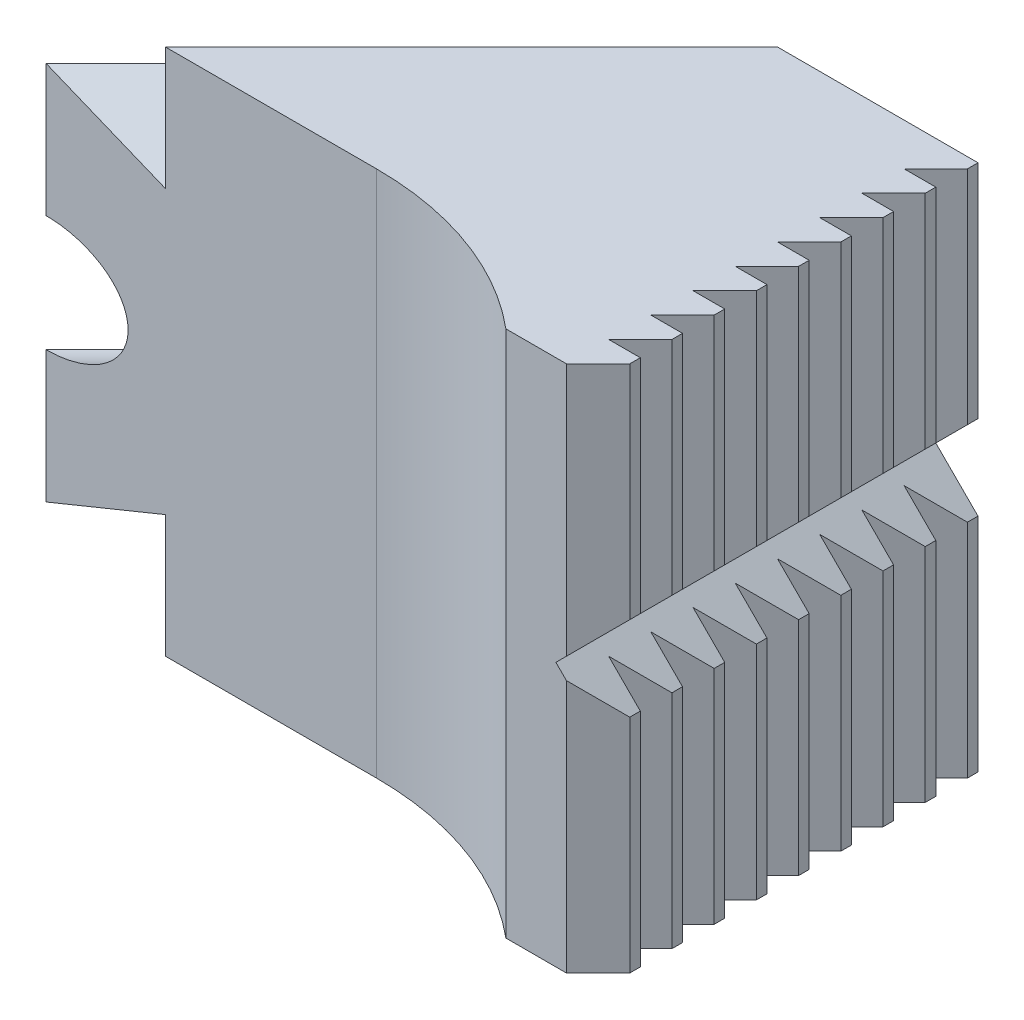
ISO-10303-21;
HEADER;
FILE_DESCRIPTION(('STEP AP214'),'2;1');
FILE_NAME('part.step','',(''),(''),'','','');
FILE_SCHEMA(('AUTOMOTIVE_DESIGN { 1 0 10303 214 1 1 1 1 }'));
ENDSEC;
DATA;
#1=APPLICATION_CONTEXT('core data for automotive mechanical design processes');
#2=APPLICATION_PROTOCOL_DEFINITION('international standard','automotive_design',2000,#1);
#3=PRODUCT_CONTEXT('',#1,'mechanical');
#4=PRODUCT('Part','Part','',(#3));
#5=PRODUCT_RELATED_PRODUCT_CATEGORY('part','',(#4));
#6=PRODUCT_DEFINITION_FORMATION('','',#4);
#7=PRODUCT_DEFINITION_CONTEXT('part definition',#1,'design');
#8=PRODUCT_DEFINITION('design','',#6,#7);
#9=PRODUCT_DEFINITION_SHAPE('','',#8);
#10=(LENGTH_UNIT() NAMED_UNIT(*) SI_UNIT(.MILLI.,.METRE.));
#11=(NAMED_UNIT(*) PLANE_ANGLE_UNIT() SI_UNIT($,.RADIAN.));
#12=(NAMED_UNIT(*) SI_UNIT($,.STERADIAN.) SOLID_ANGLE_UNIT());
#13=UNCERTAINTY_MEASURE_WITH_UNIT(LENGTH_MEASURE(1.E-05),#10,'distance_accuracy_value','');
#14=(GEOMETRIC_REPRESENTATION_CONTEXT(3) GLOBAL_UNCERTAINTY_ASSIGNED_CONTEXT((#13)) GLOBAL_UNIT_ASSIGNED_CONTEXT((#10,
#11,#12)) REPRESENTATION_CONTEXT('',''));
#15=CARTESIAN_POINT('',(0.,0.,0.));
#16=DIRECTION('',(0.,0.,1.));
#17=DIRECTION('',(1.,0.,0.));
#18=AXIS2_PLACEMENT_3D('',#15,#16,#17);
#19=CARTESIAN_POINT('',(0.,12.5,0.));
#20=DIRECTION('',(0.,0.,-1.));
#21=DIRECTION('',(-1.,0.,0.));
#22=AXIS2_PLACEMENT_3D('',#19,#20,#21);
#23=PLANE('',#22);
#24=DIRECTION('',(1.,0.,0.));
#25=VECTOR('',#24,1.);
#26=CARTESIAN_POINT('',(0.,-12.5,0.));
#27=LINE('',#26,#25);
#28=CARTESIAN_POINT('',(5.6568542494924,-12.5,0.));
#29=VERTEX_POINT('',#28);
#30=CARTESIAN_POINT('',(15.16,-12.5,0.));
#31=VERTEX_POINT('',#30);
#32=EDGE_CURVE('E802',#29,#31,#27,.T.);
#33=ORIENTED_EDGE('',*,*,#32,.F.);
#34=DIRECTION('',(0.,1.,0.));
#35=VECTOR('',#34,1.);
#36=CARTESIAN_POINT('',(5.6568542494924,12.5,0.));
#37=LINE('',#36,#35);
#38=CARTESIAN_POINT('',(5.6568542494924,-6.6905989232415,0.));
#39=VERTEX_POINT('',#38);
#40=EDGE_CURVE('E515',#29,#39,#37,.T.);
#41=ORIENTED_EDGE('',*,*,#40,.T.);
#42=DIRECTION('',(-0.925820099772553,-0.377964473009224,0.));
#43=VECTOR('',#42,1.);
#44=CARTESIAN_POINT('',(7.52343278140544,-5.92857142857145,0.));
#45=LINE('',#44,#43);
#46=CARTESIAN_POINT('',(0.,-9.,0.));
#47=VERTEX_POINT('',#46);
#48=EDGE_CURVE('E521',#39,#47,#45,.T.);
#49=ORIENTED_EDGE('',*,*,#48,.T.);
#50=DIRECTION('',(0.,-1.,0.));
#51=VECTOR('',#50,1.);
#52=CARTESIAN_POINT('',(0.,12.5,0.));
#53=LINE('',#52,#51);
#54=CARTESIAN_POINT('',(0.,9.,0.));
#55=VERTEX_POINT('',#54);
#56=EDGE_CURVE('E897',#55,#47,#53,.T.);
#57=ORIENTED_EDGE('',*,*,#56,.F.);
#58=DIRECTION('',(0.925820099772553,-0.377964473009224,0.));
#59=VECTOR('',#58,1.);
#60=CARTESIAN_POINT('',(-1.22474487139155,9.5,0.));
#61=LINE('',#60,#59);
#62=CARTESIAN_POINT('',(5.6568542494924,6.69059892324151,0.));
#63=VERTEX_POINT('',#62);
#64=EDGE_CURVE('E518',#55,#63,#61,.T.);
#65=ORIENTED_EDGE('',*,*,#64,.T.);
#66=DIRECTION('',(0.,1.,0.));
#67=VECTOR('',#66,1.);
#68=CARTESIAN_POINT('',(5.6568542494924,12.5,0.));
#69=LINE('',#68,#67);
#70=CARTESIAN_POINT('',(5.6568542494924,12.5,0.));
#71=VERTEX_POINT('',#70);
#72=EDGE_CURVE('E509',#63,#71,#69,.T.);
#73=ORIENTED_EDGE('',*,*,#72,.T.);
#74=DIRECTION('',(1.,0.,0.));
#75=VECTOR('',#74,1.);
#76=CARTESIAN_POINT('',(0.,12.5,0.));
#77=LINE('',#76,#75);
#78=CARTESIAN_POINT('',(15.16,12.5,0.));
#79=VERTEX_POINT('',#78);
#80=EDGE_CURVE('E891',#71,#79,#77,.T.);
#81=ORIENTED_EDGE('',*,*,#80,.T.);
#82=DIRECTION('',(0.,-1.,0.));
#83=VECTOR('',#82,1.);
#84=CARTESIAN_POINT('',(15.16,12.5,0.));
#85=LINE('',#84,#83);
#86=CARTESIAN_POINT('',(15.16,2.,0.));
#87=VERTEX_POINT('',#86);
#88=EDGE_CURVE('E900',#79,#87,#85,.T.);
#89=ORIENTED_EDGE('',*,*,#88,.T.);
#90=DIRECTION('',(-0.707106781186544,-0.707106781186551,0.));
#91=VECTOR('',#90,1.);
#92=CARTESIAN_POINT('',(15.5,2.34,0.));
#93=LINE('',#92,#91);
#94=CARTESIAN_POINT('',(13.1599999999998,0.,0.));
#95=VERTEX_POINT('',#94);
#96=EDGE_CURVE('E479',#87,#95,#93,.T.);
#97=ORIENTED_EDGE('',*,*,#96,.T.);
#98=DIRECTION('',(-0.707106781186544,0.707106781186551,0.));
#99=VECTOR('',#98,1.);
#100=CARTESIAN_POINT('',(15.5,-2.34,0.));
#101=LINE('',#100,#99);
#102=CARTESIAN_POINT('',(15.16,-2.,0.));
#103=VERTEX_POINT('',#102);
#104=EDGE_CURVE('E574',#103,#95,#101,.T.);
#105=ORIENTED_EDGE('',*,*,#104,.F.);
#106=EDGE_CURVE('E899',#103,#31,#85,.T.);
#107=ORIENTED_EDGE('',*,*,#106,.T.);
#108=EDGE_LOOP('',(#33,#41,#49,#57,#65,#73,#81,#89,#97,#105,#107));
#109=FACE_BOUND('',#108,.T.);
#110=ADVANCED_FACE('F14',(#109),#23,.T.);
#111=CARTESIAN_POINT('',(1.15999999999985,12.5,14.5));
#112=DIRECTION('',(0.,0.,1.));
#113=DIRECTION('',(1.,0.,0.));
#114=AXIS2_PLACEMENT_3D('',#111,#112,#113);
#115=PLANE('',#114);
#116=DIRECTION('',(0.925820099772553,0.377964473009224,0.));
#117=VECTOR('',#116,1.);
#118=CARTESIAN_POINT('',(6.44628992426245,-0.448712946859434,14.5));
#119=LINE('',#118,#117);
#120=CARTESIAN_POINT('',(-14.5000000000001,-9.,14.5));
#121=VERTEX_POINT('',#120);
#122=CARTESIAN_POINT('',(-8.84314575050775,-6.6905989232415,14.5));
#123=VERTEX_POINT('',#122);
#124=EDGE_CURVE('E9',#121,#123,#119,.T.);
#125=ORIENTED_EDGE('',*,*,#124,.T.);
#126=DIRECTION('',(0.,-1.,0.));
#127=VECTOR('',#126,1.);
#128=CARTESIAN_POINT('',(-8.84314575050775,12.5,14.5));
#129=LINE('',#128,#127);
#130=CARTESIAN_POINT('',(-8.84314575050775,-12.5,14.5));
#131=VERTEX_POINT('',#130);
#132=EDGE_CURVE('E512',#123,#131,#129,.T.);
#133=ORIENTED_EDGE('',*,*,#132,.T.);
#134=DIRECTION('',(-1.,0.,0.));
#135=VECTOR('',#134,1.);
#136=CARTESIAN_POINT('',(1.15999999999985,-12.5,14.5));
#137=LINE('',#136,#135);
#138=CARTESIAN_POINT('',(1.15999999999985,-12.5,14.5));
#139=VERTEX_POINT('',#138);
#140=EDGE_CURVE('E716',#139,#131,#137,.T.);
#141=ORIENTED_EDGE('',*,*,#140,.F.);
#142=DIRECTION('',(0.,-1.,0.));
#143=VECTOR('',#142,1.);
#144=CARTESIAN_POINT('',(1.15999999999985,12.5,14.5));
#145=LINE('',#144,#143);
#146=CARTESIAN_POINT('',(1.15999999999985,12.5,14.5));
#147=VERTEX_POINT('',#146);
#148=EDGE_CURVE('E1009',#147,#139,#145,.T.);
#149=ORIENTED_EDGE('',*,*,#148,.F.);
#150=DIRECTION('',(-1.,0.,0.));
#151=VECTOR('',#150,1.);
#152=CARTESIAN_POINT('',(1.15999999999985,12.5,14.5));
#153=LINE('',#152,#151);
#154=CARTESIAN_POINT('',(-8.84314575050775,12.5,14.5));
#155=VERTEX_POINT('',#154);
#156=EDGE_CURVE('E720',#147,#155,#153,.T.);
#157=ORIENTED_EDGE('',*,*,#156,.T.);
#158=DIRECTION('',(0.,-1.,0.));
#159=VECTOR('',#158,1.);
#160=CARTESIAN_POINT('',(-8.84314575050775,12.5,14.5));
#161=LINE('',#160,#159);
#162=CARTESIAN_POINT('',(-8.84314575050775,6.69059892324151,14.5));
#163=VERTEX_POINT('',#162);
#164=EDGE_CURVE('E37',#155,#163,#161,.T.);
#165=ORIENTED_EDGE('',*,*,#164,.T.);
#166=DIRECTION('',(-0.925820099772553,0.377964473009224,0.));
#167=VECTOR('',#166,1.);
#168=CARTESIAN_POINT('',(-2.30188772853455,4.02014151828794,14.5));
#169=LINE('',#168,#167);
#170=CARTESIAN_POINT('',(-14.5000000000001,9.,14.5));
#171=VERTEX_POINT('',#170);
#172=EDGE_CURVE('E22',#163,#171,#169,.T.);
#173=ORIENTED_EDGE('',*,*,#172,.T.);
#174=DIRECTION('',(0.,-1.,0.));
#175=VECTOR('',#174,1.);
#176=CARTESIAN_POINT('',(-14.5,12.5,14.5));
#177=LINE('',#176,#175);
#178=CARTESIAN_POINT('',(-14.5,2.75,14.5));
#179=VERTEX_POINT('',#178);
#180=EDGE_CURVE('E895',#171,#179,#177,.T.);
#181=ORIENTED_EDGE('',*,*,#180,.T.);
#182=CARTESIAN_POINT('',(-14.5,0.,14.5));
#183=DIRECTION('',(0.,0.,1.));
#184=DIRECTION('',(-1.,0.,0.));
#185=AXIS2_PLACEMENT_3D('',#182,#183,#184);
#186=ELLIPSE('',#185,3.88908729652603,2.75);
#187=CARTESIAN_POINT('',(-14.5,-2.75,14.5));
#188=VERTEX_POINT('',#187);
#189=EDGE_CURVE('E713',#188,#179,#186,.T.);
#190=ORIENTED_EDGE('',*,*,#189,.F.);
#191=EDGE_CURVE('E809',#188,#121,#177,.T.);
#192=ORIENTED_EDGE('',*,*,#191,.T.);
#193=EDGE_LOOP('',(#125,#133,#141,#149,#157,#165,#173,#181,#190,#192));
#194=FACE_BOUND('',#193,.T.);
#195=ADVANCED_FACE('F1026',(#194),#115,.T.);
#196=CARTESIAN_POINT('',(1.15999999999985,-12.5,29.5));
#197=DIRECTION('',(0.,1.,0.));
#198=DIRECTION('',(0.,0.,1.));
#199=AXIS2_PLACEMENT_3D('',#196,#197,#198);
#200=PLANE('',#199);
#201=DIRECTION('',(-0.707106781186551,0.,0.707106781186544));
#202=VECTOR('',#201,1.);
#203=CARTESIAN_POINT('',(-11.3415728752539,-12.5,16.9984271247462));
#204=LINE('',#203,#202);
#205=EDGE_CURVE('E1023',#29,#131,#204,.T.);
#206=ORIENTED_EDGE('',*,*,#205,.F.);
#207=ORIENTED_EDGE('',*,*,#32,.T.);
#208=DIRECTION('',(0.,0.,-1.));
#209=VECTOR('',#208,1.);
#210=CARTESIAN_POINT('',(15.16,-12.5,0.5));
#211=LINE('',#210,#209);
#212=CARTESIAN_POINT('',(15.16,-12.5,0.5));
#213=VERTEX_POINT('',#212);
#214=EDGE_CURVE('E799',#213,#31,#211,.T.);
#215=ORIENTED_EDGE('',*,*,#214,.F.);
#216=DIRECTION('',(-0.707106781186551,0.,0.707106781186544));
#217=VECTOR('',#216,1.);
#218=CARTESIAN_POINT('',(15.16,-12.5,0.5));
#219=LINE('',#218,#217);
#220=CARTESIAN_POINT('',(13.6599999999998,-12.5,2.));
#221=VERTEX_POINT('',#220);
#222=EDGE_CURVE('E796',#213,#221,#219,.T.);
#223=ORIENTED_EDGE('',*,*,#222,.T.);
#224=DIRECTION('',(-1.,0.,0.));
#225=VECTOR('',#224,1.);
#226=CARTESIAN_POINT('',(15.16,-12.5,2.));
#227=LINE('',#226,#225);
#228=CARTESIAN_POINT('',(15.16,-12.5,2.));
#229=VERTEX_POINT('',#228);
#230=EDGE_CURVE('E793',#229,#221,#227,.T.);
#231=ORIENTED_EDGE('',*,*,#230,.F.);
#232=DIRECTION('',(0.,0.,-1.));
#233=VECTOR('',#232,1.);
#234=CARTESIAN_POINT('',(15.16,-12.5,2.5));
#235=LINE('',#234,#233);
#236=CARTESIAN_POINT('',(15.16,-12.5,2.5));
#237=VERTEX_POINT('',#236);
#238=EDGE_CURVE('E790',#237,#229,#235,.T.);
#239=ORIENTED_EDGE('',*,*,#238,.F.);
#240=DIRECTION('',(-0.707106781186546,0.,0.707106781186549));
#241=VECTOR('',#240,1.);
#242=CARTESIAN_POINT('',(15.16,-12.5,2.5));
#243=LINE('',#242,#241);
#244=CARTESIAN_POINT('',(13.6599999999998,-12.5,4.));
#245=VERTEX_POINT('',#244);
#246=EDGE_CURVE('E787',#237,#245,#243,.T.);
#247=ORIENTED_EDGE('',*,*,#246,.T.);
#248=DIRECTION('',(-1.,0.,0.));
#249=VECTOR('',#248,1.);
#250=CARTESIAN_POINT('',(15.16,-12.5,4.));
#251=LINE('',#250,#249);
#252=CARTESIAN_POINT('',(15.16,-12.5,4.));
#253=VERTEX_POINT('',#252);
#254=EDGE_CURVE('E784',#253,#245,#251,.T.);
#255=ORIENTED_EDGE('',*,*,#254,.F.);
#256=DIRECTION('',(0.,0.,-1.));
#257=VECTOR('',#256,1.);
#258=CARTESIAN_POINT('',(15.16,-12.5,4.5));
#259=LINE('',#258,#257);
#260=CARTESIAN_POINT('',(15.16,-12.5,4.5));
#261=VERTEX_POINT('',#260);
#262=EDGE_CURVE('E781',#261,#253,#259,.T.);
#263=ORIENTED_EDGE('',*,*,#262,.F.);
#264=DIRECTION('',(-0.707106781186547,0.,0.707106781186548));
#265=VECTOR('',#264,1.);
#266=CARTESIAN_POINT('',(15.16,-12.5,4.5));
#267=LINE('',#266,#265);
#268=CARTESIAN_POINT('',(13.6599999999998,-12.5,6.));
#269=VERTEX_POINT('',#268);
#270=EDGE_CURVE('E778',#261,#269,#267,.T.);
#271=ORIENTED_EDGE('',*,*,#270,.T.);
#272=DIRECTION('',(-1.,0.,0.));
#273=VECTOR('',#272,1.);
#274=CARTESIAN_POINT('',(15.16,-12.5,6.));
#275=LINE('',#274,#273);
#276=CARTESIAN_POINT('',(15.16,-12.5,6.));
#277=VERTEX_POINT('',#276);
#278=EDGE_CURVE('E775',#277,#269,#275,.T.);
#279=ORIENTED_EDGE('',*,*,#278,.F.);
#280=DIRECTION('',(0.,0.,-1.));
#281=VECTOR('',#280,1.);
#282=CARTESIAN_POINT('',(15.16,-12.5,6.5));
#283=LINE('',#282,#281);
#284=CARTESIAN_POINT('',(15.16,-12.5,6.5));
#285=VERTEX_POINT('',#284);
#286=EDGE_CURVE('E772',#285,#277,#283,.T.);
#287=ORIENTED_EDGE('',*,*,#286,.F.);
#288=DIRECTION('',(-0.707106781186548,0.,0.707106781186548));
#289=VECTOR('',#288,1.);
#290=CARTESIAN_POINT('',(15.16,-12.5,6.5));
#291=LINE('',#290,#289);
#292=CARTESIAN_POINT('',(13.6599999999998,-12.5,8.));
#293=VERTEX_POINT('',#292);
#294=EDGE_CURVE('E769',#285,#293,#291,.T.);
#295=ORIENTED_EDGE('',*,*,#294,.T.);
#296=DIRECTION('',(-1.,0.,0.));
#297=VECTOR('',#296,1.);
#298=CARTESIAN_POINT('',(15.16,-12.5,8.));
#299=LINE('',#298,#297);
#300=CARTESIAN_POINT('',(15.16,-12.5,8.));
#301=VERTEX_POINT('',#300);
#302=EDGE_CURVE('E766',#301,#293,#299,.T.);
#303=ORIENTED_EDGE('',*,*,#302,.F.);
#304=DIRECTION('',(0.,0.,-1.));
#305=VECTOR('',#304,1.);
#306=CARTESIAN_POINT('',(15.16,-12.5,8.5));
#307=LINE('',#306,#305);
#308=CARTESIAN_POINT('',(15.16,-12.5,8.5));
#309=VERTEX_POINT('',#308);
#310=EDGE_CURVE('E763',#309,#301,#307,.T.);
#311=ORIENTED_EDGE('',*,*,#310,.F.);
#312=DIRECTION('',(-0.707106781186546,0.,0.70710678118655));
#313=VECTOR('',#312,1.);
#314=CARTESIAN_POINT('',(15.16,-12.5,8.5));
#315=LINE('',#314,#313);
#316=CARTESIAN_POINT('',(13.6599999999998,-12.5,10.));
#317=VERTEX_POINT('',#316);
#318=EDGE_CURVE('E760',#309,#317,#315,.T.);
#319=ORIENTED_EDGE('',*,*,#318,.T.);
#320=DIRECTION('',(-1.,0.,0.));
#321=VECTOR('',#320,1.);
#322=CARTESIAN_POINT('',(15.16,-12.5,10.));
#323=LINE('',#322,#321);
#324=CARTESIAN_POINT('',(15.16,-12.5,10.));
#325=VERTEX_POINT('',#324);
#326=EDGE_CURVE('E757',#325,#317,#323,.T.);
#327=ORIENTED_EDGE('',*,*,#326,.F.);
#328=DIRECTION('',(0.,0.,-1.));
#329=VECTOR('',#328,1.);
#330=CARTESIAN_POINT('',(15.16,-12.5,10.5));
#331=LINE('',#330,#329);
#332=CARTESIAN_POINT('',(15.16,-12.5,10.5));
#333=VERTEX_POINT('',#332);
#334=EDGE_CURVE('E754',#333,#325,#331,.T.);
#335=ORIENTED_EDGE('',*,*,#334,.F.);
#336=DIRECTION('',(-0.707106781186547,0.,0.707106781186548));
#337=VECTOR('',#336,1.);
#338=CARTESIAN_POINT('',(15.16,-12.5,10.5));
#339=LINE('',#338,#337);
#340=CARTESIAN_POINT('',(13.6599999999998,-12.5,12.));
#341=VERTEX_POINT('',#340);
#342=EDGE_CURVE('E751',#333,#341,#339,.T.);
#343=ORIENTED_EDGE('',*,*,#342,.T.);
#344=DIRECTION('',(-1.,0.,0.));
#345=VECTOR('',#344,1.);
#346=CARTESIAN_POINT('',(15.16,-12.5,12.));
#347=LINE('',#346,#345);
#348=CARTESIAN_POINT('',(15.16,-12.5,12.));
#349=VERTEX_POINT('',#348);
#350=EDGE_CURVE('E748',#349,#341,#347,.T.);
#351=ORIENTED_EDGE('',*,*,#350,.F.);
#352=DIRECTION('',(0.,0.,-1.));
#353=VECTOR('',#352,1.);
#354=CARTESIAN_POINT('',(15.16,-12.5,12.5));
#355=LINE('',#354,#353);
#356=CARTESIAN_POINT('',(15.16,-12.5,12.5));
#357=VERTEX_POINT('',#356);
#358=EDGE_CURVE('E745',#357,#349,#355,.T.);
#359=ORIENTED_EDGE('',*,*,#358,.F.);
#360=DIRECTION('',(-0.707106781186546,0.,0.707106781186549));
#361=VECTOR('',#360,1.);
#362=CARTESIAN_POINT('',(15.16,-12.5,12.5));
#363=LINE('',#362,#361);
#364=CARTESIAN_POINT('',(13.6599999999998,-12.5,14.));
#365=VERTEX_POINT('',#364);
#366=EDGE_CURVE('E742',#357,#365,#363,.T.);
#367=ORIENTED_EDGE('',*,*,#366,.T.);
#368=DIRECTION('',(-1.,0.,0.));
#369=VECTOR('',#368,1.);
#370=CARTESIAN_POINT('',(15.16,-12.5,14.));
#371=LINE('',#370,#369);
#372=CARTESIAN_POINT('',(15.16,-12.5,14.));
#373=VERTEX_POINT('',#372);
#374=EDGE_CURVE('E739',#373,#365,#371,.T.);
#375=ORIENTED_EDGE('',*,*,#374,.F.);
#376=DIRECTION('',(0.,0.,-1.));
#377=VECTOR('',#376,1.);
#378=CARTESIAN_POINT('',(15.16,-12.5,14.5));
#379=LINE('',#378,#377);
#380=CARTESIAN_POINT('',(15.16,-12.5,14.5));
#381=VERTEX_POINT('',#380);
#382=EDGE_CURVE('E736',#381,#373,#379,.T.);
#383=ORIENTED_EDGE('',*,*,#382,.F.);
#384=DIRECTION('',(-0.707106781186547,0.,0.707106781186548));
#385=VECTOR('',#384,1.);
#386=CARTESIAN_POINT('',(15.16,-12.5,14.5));
#387=LINE('',#386,#385);
#388=CARTESIAN_POINT('',(13.6599999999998,-12.5,16.));
#389=VERTEX_POINT('',#388);
#390=EDGE_CURVE('E733',#381,#389,#387,.T.);
#391=ORIENTED_EDGE('',*,*,#390,.T.);
#392=DIRECTION('',(-1.,0.,0.));
#393=VECTOR('',#392,1.);
#394=CARTESIAN_POINT('',(15.16,-12.5,16.));
#395=LINE('',#394,#393);
#396=CARTESIAN_POINT('',(15.16,-12.5,16.));
#397=VERTEX_POINT('',#396);
#398=EDGE_CURVE('E730',#397,#389,#395,.T.);
#399=ORIENTED_EDGE('',*,*,#398,.F.);
#400=DIRECTION('',(0.,0.,-1.));
#401=VECTOR('',#400,1.);
#402=CARTESIAN_POINT('',(15.16,-12.5,16.5));
#403=LINE('',#402,#401);
#404=CARTESIAN_POINT('',(15.16,-12.5,16.5));
#405=VERTEX_POINT('',#404);
#406=EDGE_CURVE('E727',#405,#397,#403,.T.);
#407=ORIENTED_EDGE('',*,*,#406,.F.);
#408=DIRECTION('',(-0.707106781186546,0.,0.707106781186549));
#409=VECTOR('',#408,1.);
#410=CARTESIAN_POINT('',(15.16,-12.5,16.5));
#411=LINE('',#410,#409);
#412=CARTESIAN_POINT('',(13.6599999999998,-12.5,18.));
#413=VERTEX_POINT('',#412);
#414=EDGE_CURVE('E724',#405,#413,#411,.T.);
#415=ORIENTED_EDGE('',*,*,#414,.T.);
#416=DIRECTION('',(-1.,0.,0.));
#417=VECTOR('',#416,1.);
#418=CARTESIAN_POINT('',(13.6599999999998,-12.5,18.));
#419=LINE('',#418,#417);
#420=CARTESIAN_POINT('',(10.790680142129,-12.5,18.));
#421=VERTEX_POINT('',#420);
#422=EDGE_CURVE('E721',#413,#421,#419,.T.);
#423=ORIENTED_EDGE('',*,*,#422,.T.);
#424=CARTESIAN_POINT('',(1.15999999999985,-12.5,29.5));
#425=DIRECTION('',(0.,1.,0.));
#426=DIRECTION('',(0.,0.,1.));
#427=AXIS2_PLACEMENT_3D('',#424,#425,#426);
#428=CIRCLE('',#427,15.);
#429=EDGE_CURVE('E717',#421,#139,#428,.T.);
#430=ORIENTED_EDGE('',*,*,#429,.T.);
#431=ORIENTED_EDGE('',*,*,#140,.T.);
#432=EDGE_LOOP('',(#206,#207,#215,#223,#231,#239,#247,#255,#263,#271,#279,#287,#295,#303,#311,
#319,#327,#335,#343,#351,#359,#367,#375,#383,#391,#399,#407,#415,#423,#430,#431));
#433=FACE_BOUND('',#432,.T.);
#434=ADVANCED_FACE('F1066',(#433),#200,.F.);
#435=CARTESIAN_POINT('',(1.15999999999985,12.5,29.5));
#436=DIRECTION('',(0.,1.,0.));
#437=DIRECTION('',(0.,0.,1.));
#438=AXIS2_PLACEMENT_3D('',#435,#436,#437);
#439=PLANE('',#438);
#440=ORIENTED_EDGE('',*,*,#80,.F.);
#441=DIRECTION('',(-0.707106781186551,0.,0.707106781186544));
#442=VECTOR('',#441,1.);
#443=CARTESIAN_POINT('',(-11.3415728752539,12.5,16.9984271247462));
#444=LINE('',#443,#442);
#445=EDGE_CURVE('E1021',#71,#155,#444,.T.);
#446=ORIENTED_EDGE('',*,*,#445,.T.);
#447=ORIENTED_EDGE('',*,*,#156,.F.);
#448=CARTESIAN_POINT('',(1.15999999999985,12.5,29.5));
#449=DIRECTION('',(0.,1.,0.));
#450=DIRECTION('',(0.,0.,1.));
#451=AXIS2_PLACEMENT_3D('',#448,#449,#450);
#452=CIRCLE('',#451,15.);
#453=CARTESIAN_POINT('',(10.790680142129,12.5,18.));
#454=VERTEX_POINT('',#453);
#455=EDGE_CURVE('E806',#454,#147,#452,.T.);
#456=ORIENTED_EDGE('',*,*,#455,.F.);
#457=DIRECTION('',(-1.,0.,0.));
#458=VECTOR('',#457,1.);
#459=CARTESIAN_POINT('',(13.6599999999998,12.5,18.));
#460=LINE('',#459,#458);
#461=CARTESIAN_POINT('',(13.6599999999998,12.5,18.));
#462=VERTEX_POINT('',#461);
#463=EDGE_CURVE('E810',#462,#454,#460,.T.);
#464=ORIENTED_EDGE('',*,*,#463,.F.);
#465=DIRECTION('',(-0.707106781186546,0.,0.707106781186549));
#466=VECTOR('',#465,1.);
#467=CARTESIAN_POINT('',(15.16,12.5,16.5));
#468=LINE('',#467,#466);
#469=CARTESIAN_POINT('',(15.16,12.5,16.5));
#470=VERTEX_POINT('',#469);
#471=EDGE_CURVE('E813',#470,#462,#468,.T.);
#472=ORIENTED_EDGE('',*,*,#471,.F.);
#473=DIRECTION('',(0.,0.,-1.));
#474=VECTOR('',#473,1.);
#475=CARTESIAN_POINT('',(15.16,12.5,16.5));
#476=LINE('',#475,#474);
#477=CARTESIAN_POINT('',(15.16,12.5,16.));
#478=VERTEX_POINT('',#477);
#479=EDGE_CURVE('E816',#470,#478,#476,.T.);
#480=ORIENTED_EDGE('',*,*,#479,.T.);
#481=DIRECTION('',(-1.,0.,0.));
#482=VECTOR('',#481,1.);
#483=CARTESIAN_POINT('',(15.16,12.5,16.));
#484=LINE('',#483,#482);
#485=CARTESIAN_POINT('',(13.6599999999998,12.5,16.));
#486=VERTEX_POINT('',#485);
#487=EDGE_CURVE('E819',#478,#486,#484,.T.);
#488=ORIENTED_EDGE('',*,*,#487,.T.);
#489=DIRECTION('',(-0.707106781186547,0.,0.707106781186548));
#490=VECTOR('',#489,1.);
#491=CARTESIAN_POINT('',(15.16,12.5,14.5));
#492=LINE('',#491,#490);
#493=CARTESIAN_POINT('',(15.16,12.5,14.5));
#494=VERTEX_POINT('',#493);
#495=EDGE_CURVE('E822',#494,#486,#492,.T.);
#496=ORIENTED_EDGE('',*,*,#495,.F.);
#497=DIRECTION('',(0.,0.,-1.));
#498=VECTOR('',#497,1.);
#499=CARTESIAN_POINT('',(15.16,12.5,14.5));
#500=LINE('',#499,#498);
#501=CARTESIAN_POINT('',(15.16,12.5,14.));
#502=VERTEX_POINT('',#501);
#503=EDGE_CURVE('E825',#494,#502,#500,.T.);
#504=ORIENTED_EDGE('',*,*,#503,.T.);
#505=DIRECTION('',(-1.,0.,0.));
#506=VECTOR('',#505,1.);
#507=CARTESIAN_POINT('',(15.16,12.5,14.));
#508=LINE('',#507,#506);
#509=CARTESIAN_POINT('',(13.6599999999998,12.5,14.));
#510=VERTEX_POINT('',#509);
#511=EDGE_CURVE('E828',#502,#510,#508,.T.);
#512=ORIENTED_EDGE('',*,*,#511,.T.);
#513=DIRECTION('',(-0.707106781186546,0.,0.707106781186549));
#514=VECTOR('',#513,1.);
#515=CARTESIAN_POINT('',(15.16,12.5,12.5));
#516=LINE('',#515,#514);
#517=CARTESIAN_POINT('',(15.16,12.5,12.5));
#518=VERTEX_POINT('',#517);
#519=EDGE_CURVE('E831',#518,#510,#516,.T.);
#520=ORIENTED_EDGE('',*,*,#519,.F.);
#521=DIRECTION('',(0.,0.,-1.));
#522=VECTOR('',#521,1.);
#523=CARTESIAN_POINT('',(15.16,12.5,12.5));
#524=LINE('',#523,#522);
#525=CARTESIAN_POINT('',(15.16,12.5,12.));
#526=VERTEX_POINT('',#525);
#527=EDGE_CURVE('E834',#518,#526,#524,.T.);
#528=ORIENTED_EDGE('',*,*,#527,.T.);
#529=DIRECTION('',(-1.,0.,0.));
#530=VECTOR('',#529,1.);
#531=CARTESIAN_POINT('',(15.16,12.5,12.));
#532=LINE('',#531,#530);
#533=CARTESIAN_POINT('',(13.6599999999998,12.5,12.));
#534=VERTEX_POINT('',#533);
#535=EDGE_CURVE('E837',#526,#534,#532,.T.);
#536=ORIENTED_EDGE('',*,*,#535,.T.);
#537=DIRECTION('',(-0.707106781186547,0.,0.707106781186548));
#538=VECTOR('',#537,1.);
#539=CARTESIAN_POINT('',(15.16,12.5,10.5));
#540=LINE('',#539,#538);
#541=CARTESIAN_POINT('',(15.16,12.5,10.5));
#542=VERTEX_POINT('',#541);
#543=EDGE_CURVE('E840',#542,#534,#540,.T.);
#544=ORIENTED_EDGE('',*,*,#543,.F.);
#545=DIRECTION('',(0.,0.,-1.));
#546=VECTOR('',#545,1.);
#547=CARTESIAN_POINT('',(15.16,12.5,10.5));
#548=LINE('',#547,#546);
#549=CARTESIAN_POINT('',(15.16,12.5,10.));
#550=VERTEX_POINT('',#549);
#551=EDGE_CURVE('E843',#542,#550,#548,.T.);
#552=ORIENTED_EDGE('',*,*,#551,.T.);
#553=DIRECTION('',(-1.,0.,0.));
#554=VECTOR('',#553,1.);
#555=CARTESIAN_POINT('',(15.16,12.5,10.));
#556=LINE('',#555,#554);
#557=CARTESIAN_POINT('',(13.6599999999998,12.5,10.));
#558=VERTEX_POINT('',#557);
#559=EDGE_CURVE('E846',#550,#558,#556,.T.);
#560=ORIENTED_EDGE('',*,*,#559,.T.);
#561=DIRECTION('',(-0.707106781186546,0.,0.70710678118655));
#562=VECTOR('',#561,1.);
#563=CARTESIAN_POINT('',(15.16,12.5,8.5));
#564=LINE('',#563,#562);
#565=CARTESIAN_POINT('',(15.16,12.5,8.5));
#566=VERTEX_POINT('',#565);
#567=EDGE_CURVE('E849',#566,#558,#564,.T.);
#568=ORIENTED_EDGE('',*,*,#567,.F.);
#569=DIRECTION('',(0.,0.,-1.));
#570=VECTOR('',#569,1.);
#571=CARTESIAN_POINT('',(15.16,12.5,8.5));
#572=LINE('',#571,#570);
#573=CARTESIAN_POINT('',(15.16,12.5,8.));
#574=VERTEX_POINT('',#573);
#575=EDGE_CURVE('E852',#566,#574,#572,.T.);
#576=ORIENTED_EDGE('',*,*,#575,.T.);
#577=DIRECTION('',(-1.,0.,0.));
#578=VECTOR('',#577,1.);
#579=CARTESIAN_POINT('',(15.16,12.5,8.));
#580=LINE('',#579,#578);
#581=CARTESIAN_POINT('',(13.6599999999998,12.5,8.));
#582=VERTEX_POINT('',#581);
#583=EDGE_CURVE('E855',#574,#582,#580,.T.);
#584=ORIENTED_EDGE('',*,*,#583,.T.);
#585=DIRECTION('',(-0.707106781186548,0.,0.707106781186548));
#586=VECTOR('',#585,1.);
#587=CARTESIAN_POINT('',(15.16,12.5,6.5));
#588=LINE('',#587,#586);
#589=CARTESIAN_POINT('',(15.16,12.5,6.5));
#590=VERTEX_POINT('',#589);
#591=EDGE_CURVE('E858',#590,#582,#588,.T.);
#592=ORIENTED_EDGE('',*,*,#591,.F.);
#593=DIRECTION('',(0.,0.,-1.));
#594=VECTOR('',#593,1.);
#595=CARTESIAN_POINT('',(15.16,12.5,6.5));
#596=LINE('',#595,#594);
#597=CARTESIAN_POINT('',(15.16,12.5,6.));
#598=VERTEX_POINT('',#597);
#599=EDGE_CURVE('E861',#590,#598,#596,.T.);
#600=ORIENTED_EDGE('',*,*,#599,.T.);
#601=DIRECTION('',(-1.,0.,0.));
#602=VECTOR('',#601,1.);
#603=CARTESIAN_POINT('',(15.16,12.5,6.));
#604=LINE('',#603,#602);
#605=CARTESIAN_POINT('',(13.6599999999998,12.5,6.));
#606=VERTEX_POINT('',#605);
#607=EDGE_CURVE('E864',#598,#606,#604,.T.);
#608=ORIENTED_EDGE('',*,*,#607,.T.);
#609=DIRECTION('',(-0.707106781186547,0.,0.707106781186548));
#610=VECTOR('',#609,1.);
#611=CARTESIAN_POINT('',(15.16,12.5,4.5));
#612=LINE('',#611,#610);
#613=CARTESIAN_POINT('',(15.16,12.5,4.5));
#614=VERTEX_POINT('',#613);
#615=EDGE_CURVE('E867',#614,#606,#612,.T.);
#616=ORIENTED_EDGE('',*,*,#615,.F.);
#617=DIRECTION('',(0.,0.,-1.));
#618=VECTOR('',#617,1.);
#619=CARTESIAN_POINT('',(15.16,12.5,4.5));
#620=LINE('',#619,#618);
#621=CARTESIAN_POINT('',(15.16,12.5,4.));
#622=VERTEX_POINT('',#621);
#623=EDGE_CURVE('E870',#614,#622,#620,.T.);
#624=ORIENTED_EDGE('',*,*,#623,.T.);
#625=DIRECTION('',(-1.,0.,0.));
#626=VECTOR('',#625,1.);
#627=CARTESIAN_POINT('',(15.16,12.5,4.));
#628=LINE('',#627,#626);
#629=CARTESIAN_POINT('',(13.6599999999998,12.5,4.));
#630=VERTEX_POINT('',#629);
#631=EDGE_CURVE('E873',#622,#630,#628,.T.);
#632=ORIENTED_EDGE('',*,*,#631,.T.);
#633=DIRECTION('',(-0.707106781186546,0.,0.707106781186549));
#634=VECTOR('',#633,1.);
#635=CARTESIAN_POINT('',(15.16,12.5,2.5));
#636=LINE('',#635,#634);
#637=CARTESIAN_POINT('',(15.16,12.5,2.5));
#638=VERTEX_POINT('',#637);
#639=EDGE_CURVE('E876',#638,#630,#636,.T.);
#640=ORIENTED_EDGE('',*,*,#639,.F.);
#641=DIRECTION('',(0.,0.,-1.));
#642=VECTOR('',#641,1.);
#643=CARTESIAN_POINT('',(15.16,12.5,2.5));
#644=LINE('',#643,#642);
#645=CARTESIAN_POINT('',(15.16,12.5,2.));
#646=VERTEX_POINT('',#645);
#647=EDGE_CURVE('E879',#638,#646,#644,.T.);
#648=ORIENTED_EDGE('',*,*,#647,.T.);
#649=DIRECTION('',(-1.,0.,0.));
#650=VECTOR('',#649,1.);
#651=CARTESIAN_POINT('',(15.16,12.5,2.));
#652=LINE('',#651,#650);
#653=CARTESIAN_POINT('',(13.6599999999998,12.5,2.));
#654=VERTEX_POINT('',#653);
#655=EDGE_CURVE('E882',#646,#654,#652,.T.);
#656=ORIENTED_EDGE('',*,*,#655,.T.);
#657=DIRECTION('',(-0.707106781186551,0.,0.707106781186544));
#658=VECTOR('',#657,1.);
#659=CARTESIAN_POINT('',(15.16,12.5,0.5));
#660=LINE('',#659,#658);
#661=CARTESIAN_POINT('',(15.16,12.5,0.5));
#662=VERTEX_POINT('',#661);
#663=EDGE_CURVE('E885',#662,#654,#660,.T.);
#664=ORIENTED_EDGE('',*,*,#663,.F.);
#665=DIRECTION('',(0.,0.,-1.));
#666=VECTOR('',#665,1.);
#667=CARTESIAN_POINT('',(15.16,12.5,0.5));
#668=LINE('',#667,#666);
#669=EDGE_CURVE('E888',#662,#79,#668,.T.);
#670=ORIENTED_EDGE('',*,*,#669,.T.);
#671=EDGE_LOOP('',(#440,#446,#447,#456,#464,#472,#480,#488,#496,#504,#512,#520,#528,#536,#544,
#552,#560,#568,#576,#584,#592,#600,#608,#616,#624,#632,#640,#648,#656,#664,#670));
#672=FACE_BOUND('',#671,.T.);
#673=ADVANCED_FACE('F1038',(#672),#439,.T.);
#674=CARTESIAN_POINT('',(-9.90380592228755,0.,9.90380592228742));
#675=DIRECTION('',(0.707106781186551,0.,-0.707106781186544));
#676=DIRECTION('',(-0.707106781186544,0.,-0.707106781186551));
#677=AXIS2_PLACEMENT_3D('',#674,#675,#676);
#678=CYLINDRICAL_SURFACE('',#677,5.);
#679=CARTESIAN_POINT('',(-9.90380592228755,0.,9.90380592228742));
#680=DIRECTION('',(-0.707106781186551,0.,0.707106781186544));
#681=DIRECTION('',(0.707106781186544,0.,0.707106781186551));
#682=AXIS2_PLACEMENT_3D('',#679,#680,#681);
#683=CIRCLE('',#682,5.);
#684=CARTESIAN_POINT('',(-9.90380592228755,5.,9.90380592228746));
#685=VERTEX_POINT('',#684);
#686=CARTESIAN_POINT('',(-9.90380592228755,-5.,9.90380592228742));
#687=VERTEX_POINT('',#686);
#688=EDGE_CURVE('E470',#685,#687,#683,.T.);
#689=ORIENTED_EDGE('',*,*,#688,.F.);
#690=DIRECTION('',(0.707106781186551,0.,-0.707106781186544));
#691=VECTOR('',#690,1.);
#692=CARTESIAN_POINT('',(-9.90380592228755,5.,9.90380592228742));
#693=LINE('',#692,#691);
#694=CARTESIAN_POINT('',(-2.83273811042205,5.,2.83273811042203));
#695=VERTEX_POINT('',#694);
#696=EDGE_CURVE('E29',#685,#695,#693,.T.);
#697=ORIENTED_EDGE('',*,*,#696,.T.);
#698=CARTESIAN_POINT('',(-2.83273811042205,0.,2.83273811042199));
#699=DIRECTION('',(-0.707106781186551,0.,0.707106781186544));
#700=DIRECTION('',(0.707106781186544,0.,0.707106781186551));
#701=AXIS2_PLACEMENT_3D('',#698,#699,#700);
#702=CIRCLE('',#701,5.);
#703=CARTESIAN_POINT('',(-2.83273811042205,-5.,2.83273811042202));
#704=VERTEX_POINT('',#703);
#705=EDGE_CURVE('E480',#695,#704,#702,.T.);
#706=ORIENTED_EDGE('',*,*,#705,.T.);
#707=DIRECTION('',(0.707106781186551,0.,-0.707106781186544));
#708=VECTOR('',#707,1.);
#709=CARTESIAN_POINT('',(-9.90380592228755,-5.,9.90380592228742));
#710=LINE('',#709,#708);
#711=EDGE_CURVE('E486',#704,#687,#710,.F.);
#712=ORIENTED_EDGE('',*,*,#711,.T.);
#713=EDGE_LOOP('',(#689,#697,#706,#712));
#714=FACE_BOUND('',#713,.T.);
#715=ADVANCED_FACE('F491',(#714),#678,.T.);
#716=CARTESIAN_POINT('',(-7.07537879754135,-2.3094010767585,7.07537879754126));
#717=DIRECTION('',(0.353553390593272,0.866025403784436,0.353553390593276));
#718=DIRECTION('',(-0.61237243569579,0.5,-0.612372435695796));
#719=AXIS2_PLACEMENT_3D('',#716,#717,#718);
#720=PLANE('',#719);
#721=DIRECTION('',(-0.707106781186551,0.,0.707106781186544));
#722=VECTOR('',#721,1.);
#723=CARTESIAN_POINT('',(-8.48959235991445,-1.15470053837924,5.66116523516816));
#724=LINE('',#723,#722);
#725=CARTESIAN_POINT('',(-8.48959235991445,-1.15470053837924,5.66116523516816));
#726=VERTEX_POINT('',#725);
#727=CARTESIAN_POINT('',(-11.3180194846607,-1.15470053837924,8.48959235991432));
#728=VERTEX_POINT('',#727);
#729=EDGE_CURVE('E571',#726,#728,#724,.T.);
#730=ORIENTED_EDGE('',*,*,#729,.T.);
#731=DIRECTION('',(-0.61237243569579,0.5,-0.612372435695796));
#732=VECTOR('',#731,1.);
#733=CARTESIAN_POINT('',(-9.90380592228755,-2.3094010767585,9.90380592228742));
#734=LINE('',#733,#732);
#735=CARTESIAN_POINT('',(-9.90380592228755,-2.3094010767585,9.90380592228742));
#736=VERTEX_POINT('',#735);
#737=EDGE_CURVE('E524',#736,#728,#734,.T.);
#738=ORIENTED_EDGE('',*,*,#737,.F.);
#739=DIRECTION('',(-0.707106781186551,0.,0.707106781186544));
#740=VECTOR('',#739,1.);
#741=CARTESIAN_POINT('',(-7.07537879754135,-2.3094010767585,7.07537879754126));
#742=LINE('',#741,#740);
#743=CARTESIAN_POINT('',(-7.07537879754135,-2.3094010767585,7.07537879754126));
#744=VERTEX_POINT('',#743);
#745=EDGE_CURVE('E546',#744,#736,#742,.T.);
#746=ORIENTED_EDGE('',*,*,#745,.F.);
#747=DIRECTION('',(-0.61237243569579,0.5,-0.612372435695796));
#748=VECTOR('',#747,1.);
#749=CARTESIAN_POINT('',(-7.07537879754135,-2.3094010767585,7.07537879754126));
#750=LINE('',#749,#748);
#751=EDGE_CURVE('E528',#744,#726,#750,.T.);
#752=ORIENTED_EDGE('',*,*,#751,.T.);
#753=EDGE_LOOP('',(#730,#738,#746,#752));
#754=FACE_BOUND('',#753,.T.);
#755=ADVANCED_FACE('F1306',(#754),#720,.T.);
#756=CARTESIAN_POINT('',(-8.48959235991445,1.15470053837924,5.66116523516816));
#757=DIRECTION('',(-0.707106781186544,0.,-0.707106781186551));
#758=DIRECTION('',(-0.707106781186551,0.,0.707106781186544));
#759=AXIS2_PLACEMENT_3D('',#756,#757,#758);
#760=PLANE('',#759);
#761=DIRECTION('',(-0.707106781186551,0.,0.707106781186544));
#762=VECTOR('',#761,1.);
#763=CARTESIAN_POINT('',(-8.48959235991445,1.15470053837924,5.66116523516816));
#764=LINE('',#763,#762);
#765=CARTESIAN_POINT('',(-8.48959235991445,1.15470053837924,5.66116523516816));
#766=VERTEX_POINT('',#765);
#767=CARTESIAN_POINT('',(-11.3180194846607,1.15470053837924,8.48959235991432));
#768=VERTEX_POINT('',#767);
#769=EDGE_CURVE('E569',#766,#768,#764,.T.);
#770=ORIENTED_EDGE('',*,*,#769,.T.);
#771=DIRECTION('',(0.,-1.,0.));
#772=VECTOR('',#771,1.);
#773=CARTESIAN_POINT('',(-11.3180194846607,1.15470053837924,8.48959235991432));
#774=LINE('',#773,#772);
#775=EDGE_CURVE('E538',#768,#728,#774,.T.);
#776=ORIENTED_EDGE('',*,*,#775,.T.);
#777=ORIENTED_EDGE('',*,*,#729,.F.);
#778=DIRECTION('',(0.,-1.,0.));
#779=VECTOR('',#778,1.);
#780=CARTESIAN_POINT('',(-8.48959235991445,1.15470053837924,5.66116523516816));
#781=LINE('',#780,#779);
#782=EDGE_CURVE('E556',#766,#726,#781,.T.);
#783=ORIENTED_EDGE('',*,*,#782,.F.);
#784=EDGE_LOOP('',(#770,#776,#777,#783));
#785=FACE_BOUND('',#784,.T.);
#786=ADVANCED_FACE('F1301',(#785),#760,.F.);
#787=CARTESIAN_POINT('',(-8.48959235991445,1.15470053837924,5.66116523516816));
#788=DIRECTION('',(0.353553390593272,-0.866025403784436,0.353553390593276));
#789=DIRECTION('',(0.612372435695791,0.5,0.612372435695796));
#790=AXIS2_PLACEMENT_3D('',#787,#788,#789);
#791=PLANE('',#790);
#792=DIRECTION('',(-0.707106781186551,0.,0.707106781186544));
#793=VECTOR('',#792,1.);
#794=CARTESIAN_POINT('',(-7.07537879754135,2.30940107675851,7.07537879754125));
#795=LINE('',#794,#793);
#796=CARTESIAN_POINT('',(-7.07537879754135,2.30940107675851,7.07537879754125));
#797=VERTEX_POINT('',#796);
#798=CARTESIAN_POINT('',(-9.90380592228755,2.30940107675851,9.90380592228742));
#799=VERTEX_POINT('',#798);
#800=EDGE_CURVE('E567',#797,#799,#795,.T.);
#801=ORIENTED_EDGE('',*,*,#800,.T.);
#802=DIRECTION('',(0.61237243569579,0.5,0.612372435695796));
#803=VECTOR('',#802,1.);
#804=CARTESIAN_POINT('',(-11.3180194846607,1.15470053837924,8.48959235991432));
#805=LINE('',#804,#803);
#806=EDGE_CURVE('E535',#768,#799,#805,.T.);
#807=ORIENTED_EDGE('',*,*,#806,.F.);
#808=ORIENTED_EDGE('',*,*,#769,.F.);
#809=DIRECTION('',(0.61237243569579,0.5,0.612372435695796));
#810=VECTOR('',#809,1.);
#811=CARTESIAN_POINT('',(-8.48959235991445,1.15470053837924,5.66116523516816));
#812=LINE('',#811,#810);
#813=EDGE_CURVE('E553',#766,#797,#812,.T.);
#814=ORIENTED_EDGE('',*,*,#813,.T.);
#815=EDGE_LOOP('',(#801,#807,#808,#814));
#816=FACE_BOUND('',#815,.T.);
#817=ADVANCED_FACE('F1338',(#816),#791,.T.);
#818=CARTESIAN_POINT('',(-5.66116523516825,1.15470053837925,8.48959235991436));
#819=DIRECTION('',(0.353553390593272,0.86602540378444,0.353553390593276));
#820=DIRECTION('',(-0.612372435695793,0.5,-0.612372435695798));
#821=AXIS2_PLACEMENT_3D('',#818,#819,#820);
#822=PLANE('',#821);
#823=DIRECTION('',(-0.707106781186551,0.,0.707106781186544));
#824=VECTOR('',#823,1.);
#825=CARTESIAN_POINT('',(-5.66116523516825,1.15470053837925,8.48959235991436));
#826=LINE('',#825,#824);
#827=CARTESIAN_POINT('',(-5.66116523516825,1.15470053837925,8.48959235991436));
#828=VERTEX_POINT('',#827);
#829=CARTESIAN_POINT('',(-8.48959235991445,1.15470053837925,11.3180194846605));
#830=VERTEX_POINT('',#829);
#831=EDGE_CURVE('E565',#828,#830,#826,.T.);
#832=ORIENTED_EDGE('',*,*,#831,.T.);
#833=DIRECTION('',(-0.612372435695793,0.5,-0.612372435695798));
#834=VECTOR('',#833,1.);
#835=CARTESIAN_POINT('',(-8.48959235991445,1.15470053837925,11.3180194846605));
#836=LINE('',#835,#834);
#837=EDGE_CURVE('E532',#830,#799,#836,.T.);
#838=ORIENTED_EDGE('',*,*,#837,.T.);
#839=ORIENTED_EDGE('',*,*,#800,.F.);
#840=DIRECTION('',(-0.612372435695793,0.5,-0.612372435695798));
#841=VECTOR('',#840,1.);
#842=CARTESIAN_POINT('',(-5.66116523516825,1.15470053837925,8.48959235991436));
#843=LINE('',#842,#841);
#844=EDGE_CURVE('E550',#828,#797,#843,.T.);
#845=ORIENTED_EDGE('',*,*,#844,.F.);
#846=EDGE_LOOP('',(#832,#838,#839,#845));
#847=FACE_BOUND('',#846,.T.);
#848=ADVANCED_FACE('F1335',(#847),#822,.F.);
#849=CARTESIAN_POINT('',(-5.66116523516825,-1.15470053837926,8.48959235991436));
#850=DIRECTION('',(0.707106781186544,0.,0.707106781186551));
#851=DIRECTION('',(0.707106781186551,0.,-0.707106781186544));
#852=AXIS2_PLACEMENT_3D('',#849,#850,#851);
#853=PLANE('',#852);
#854=DIRECTION('',(-0.707106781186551,0.,0.707106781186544));
#855=VECTOR('',#854,1.);
#856=CARTESIAN_POINT('',(-5.66116523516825,-1.15470053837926,8.48959235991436));
#857=LINE('',#856,#855);
#858=CARTESIAN_POINT('',(-5.66116523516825,-1.15470053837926,8.48959235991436));
#859=VERTEX_POINT('',#858);
#860=CARTESIAN_POINT('',(-8.48959235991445,-1.15470053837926,11.3180194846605));
#861=VERTEX_POINT('',#860);
#862=EDGE_CURVE('E563',#859,#861,#857,.T.);
#863=ORIENTED_EDGE('',*,*,#862,.T.);
#864=DIRECTION('',(0.,1.,0.));
#865=VECTOR('',#864,1.);
#866=CARTESIAN_POINT('',(-8.48959235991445,-1.15470053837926,11.3180194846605));
#867=LINE('',#866,#865);
#868=EDGE_CURVE('E529',#861,#830,#867,.T.);
#869=ORIENTED_EDGE('',*,*,#868,.T.);
#870=ORIENTED_EDGE('',*,*,#831,.F.);
#871=DIRECTION('',(0.,1.,0.));
#872=VECTOR('',#871,1.);
#873=CARTESIAN_POINT('',(-5.66116523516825,-1.15470053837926,8.48959235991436));
#874=LINE('',#873,#872);
#875=EDGE_CURVE('E547',#859,#828,#874,.T.);
#876=ORIENTED_EDGE('',*,*,#875,.F.);
#877=EDGE_LOOP('',(#863,#869,#870,#876));
#878=FACE_BOUND('',#877,.T.);
#879=ADVANCED_FACE('F1326',(#878),#853,.F.);
#880=CARTESIAN_POINT('',(-7.07537879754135,-2.3094010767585,7.07537879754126));
#881=DIRECTION('',(0.353553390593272,-0.86602540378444,0.353553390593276));
#882=DIRECTION('',(0.612372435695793,0.5,0.612372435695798));
#883=AXIS2_PLACEMENT_3D('',#880,#881,#882);
#884=PLANE('',#883);
#885=DIRECTION('',(0.612372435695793,0.5,0.612372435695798));
#886=VECTOR('',#885,1.);
#887=CARTESIAN_POINT('',(-7.07537879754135,-2.3094010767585,7.07537879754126));
#888=LINE('',#887,#886);
#889=EDGE_CURVE('E543',#744,#859,#888,.T.);
#890=ORIENTED_EDGE('',*,*,#889,.F.);
#891=ORIENTED_EDGE('',*,*,#745,.T.);
#892=DIRECTION('',(0.612372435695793,0.5,0.612372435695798));
#893=VECTOR('',#892,1.);
#894=CARTESIAN_POINT('',(-9.90380592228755,-2.3094010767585,9.90380592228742));
#895=LINE('',#894,#893);
#896=EDGE_CURVE('E525',#736,#861,#895,.T.);
#897=ORIENTED_EDGE('',*,*,#896,.T.);
#898=ORIENTED_EDGE('',*,*,#862,.F.);
#899=EDGE_LOOP('',(#890,#891,#897,#898));
#900=FACE_BOUND('',#899,.T.);
#901=ADVANCED_FACE('F1299',(#900),#884,.F.);
#902=CARTESIAN_POINT('',(-9.90380592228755,0.,4.24695167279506));
#903=DIRECTION('',(0.707106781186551,0.,-0.707106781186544));
#904=DIRECTION('',(-0.707106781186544,0.,-0.707106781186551));
#905=AXIS2_PLACEMENT_3D('',#902,#903,#904);
#906=PLANE('',#905);
#907=ORIENTED_EDGE('',*,*,#751,.F.);
#908=ORIENTED_EDGE('',*,*,#889,.T.);
#909=ORIENTED_EDGE('',*,*,#875,.T.);
#910=ORIENTED_EDGE('',*,*,#844,.T.);
#911=ORIENTED_EDGE('',*,*,#813,.F.);
#912=ORIENTED_EDGE('',*,*,#782,.T.);
#913=EDGE_LOOP('',(#907,#908,#909,#910,#911,#912));
#914=FACE_BOUND('',#913,.T.);
#915=ADVANCED_FACE('F1297',(#914),#906,.F.);
#916=CARTESIAN_POINT('',(-9.90380592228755,0.,9.90380592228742));
#917=DIRECTION('',(-0.707106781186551,0.,0.707106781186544));
#918=DIRECTION('',(0.707106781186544,0.,0.707106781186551));
#919=AXIS2_PLACEMENT_3D('',#916,#917,#918);
#920=PLANE('',#919);
#921=ORIENTED_EDGE('',*,*,#688,.T.);
#922=DIRECTION('',(0.,1.,0.));
#923=VECTOR('',#922,1.);
#924=CARTESIAN_POINT('',(-9.90380592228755,12.5,9.90380592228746));
#925=LINE('',#924,#923);
#926=CARTESIAN_POINT('',(-9.90380592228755,-2.75,9.90380592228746));
#927=VERTEX_POINT('',#926);
#928=EDGE_CURVE('E475',#687,#927,#925,.T.);
#929=ORIENTED_EDGE('',*,*,#928,.T.);
#930=CARTESIAN_POINT('',(-9.90380592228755,0.,9.90380592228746));
#931=DIRECTION('',(-0.707106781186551,0.,0.707106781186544));
#932=DIRECTION('',(0.707106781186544,0.,0.707106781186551));
#933=AXIS2_PLACEMENT_3D('',#930,#931,#932);
#934=CIRCLE('',#933,2.75);
#935=CARTESIAN_POINT('',(-9.90380592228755,2.75,9.90380592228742));
#936=VERTEX_POINT('',#935);
#937=EDGE_CURVE('E711',#927,#936,#934,.T.);
#938=ORIENTED_EDGE('',*,*,#937,.T.);
#939=EDGE_CURVE('E477',#936,#685,#925,.T.);
#940=ORIENTED_EDGE('',*,*,#939,.T.);
#941=EDGE_LOOP('',(#921,#929,#938,#940));
#942=FACE_BOUND('',#941,.T.);
#943=ORIENTED_EDGE('',*,*,#896,.F.);
#944=ORIENTED_EDGE('',*,*,#737,.T.);
#945=ORIENTED_EDGE('',*,*,#775,.F.);
#946=ORIENTED_EDGE('',*,*,#806,.T.);
#947=ORIENTED_EDGE('',*,*,#837,.F.);
#948=ORIENTED_EDGE('',*,*,#868,.F.);
#949=EDGE_LOOP('',(#943,#944,#945,#946,#947,#948));
#950=FACE_BOUND('',#949,.T.);
#951=ADVANCED_FACE('F472',(#942,#950),#920,.T.);
#952=CARTESIAN_POINT('',(-2.83273811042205,0.,2.83273811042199));
#953=DIRECTION('',(-0.707106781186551,0.,0.707106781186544));
#954=DIRECTION('',(0.707106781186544,0.,0.707106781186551));
#955=AXIS2_PLACEMENT_3D('',#952,#953,#954);
#956=PLANE('',#955);
#957=DIRECTION('',(0.,-1.,0.));
#958=VECTOR('',#957,1.);
#959=CARTESIAN_POINT('',(-2.83273811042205,12.5,2.83273811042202));
#960=LINE('',#959,#958);
#961=EDGE_CURVE('E1011',#695,#704,#960,.T.);
#962=ORIENTED_EDGE('',*,*,#961,.T.);
#963=ORIENTED_EDGE('',*,*,#705,.F.);
#964=EDGE_LOOP('',(#962,#963));
#965=FACE_BOUND('',#964,.T.);
#966=ADVANCED_FACE('F1286',(#965),#956,.F.);
#967=CARTESIAN_POINT('',(-14.5,12.5,14.5));
#968=DIRECTION('',(-0.707106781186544,0.,-0.707106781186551));
#969=DIRECTION('',(-0.707106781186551,0.,0.707106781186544));
#970=AXIS2_PLACEMENT_3D('',#967,#968,#969);
#971=PLANE('',#970);
#972=ORIENTED_EDGE('',*,*,#961,.F.);
#973=ORIENTED_EDGE('',*,*,#696,.F.);
#974=ORIENTED_EDGE('',*,*,#939,.F.);
#975=DIRECTION('',(-0.707106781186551,0.,0.707106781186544));
#976=VECTOR('',#975,1.);
#977=CARTESIAN_POINT('',(-21.3921356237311,2.75,21.3921356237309));
#978=LINE('',#977,#976);
#979=EDGE_CURVE('E489',#179,#936,#978,.F.);
#980=ORIENTED_EDGE('',*,*,#979,.F.);
#981=ORIENTED_EDGE('',*,*,#180,.F.);
#982=DIRECTION('',(0.707106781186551,0.,-0.707106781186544));
#983=VECTOR('',#982,1.);
#984=CARTESIAN_POINT('',(-79.038806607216,9.,79.0388066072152));
#985=LINE('',#984,#983);
#986=EDGE_CURVE('E499',#171,#55,#985,.T.);
#987=ORIENTED_EDGE('',*,*,#986,.T.);
#988=ORIENTED_EDGE('',*,*,#56,.T.);
#989=DIRECTION('',(0.707106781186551,0.,-0.707106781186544));
#990=VECTOR('',#989,1.);
#991=CARTESIAN_POINT('',(-79.038806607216,-9.,79.0388066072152));
#992=LINE('',#991,#990);
#993=EDGE_CURVE('E502',#121,#47,#992,.T.);
#994=ORIENTED_EDGE('',*,*,#993,.F.);
#995=ORIENTED_EDGE('',*,*,#191,.F.);
#996=DIRECTION('',(-0.707106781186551,0.,0.707106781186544));
#997=VECTOR('',#996,1.);
#998=CARTESIAN_POINT('',(-21.3921356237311,-2.75,21.3921356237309));
#999=LINE('',#998,#997);
#1000=EDGE_CURVE('E488',#927,#188,#999,.T.);
#1001=ORIENTED_EDGE('',*,*,#1000,.F.);
#1002=ORIENTED_EDGE('',*,*,#928,.F.);
#1003=ORIENTED_EDGE('',*,*,#711,.F.);
#1004=EDGE_LOOP('',(#972,#973,#974,#980,#981,#987,#988,#994,#995,#1001,#1002,#1003));
#1005=FACE_BOUND('',#1004,.T.);
#1006=ADVANCED_FACE('F485',(#1005),#971,.T.);
#1007=CARTESIAN_POINT('',(13.6599999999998,12.5,18.));
#1008=DIRECTION('',(0.,0.,1.));
#1009=DIRECTION('',(1.,0.,0.));
#1010=AXIS2_PLACEMENT_3D('',#1007,#1008,#1009);
#1011=PLANE('',#1010);
#1012=DIRECTION('',(-0.707106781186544,0.707106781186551,0.));
#1013=VECTOR('',#1012,1.);
#1014=CARTESIAN_POINT('',(15.5,-2.34,18.));
#1015=LINE('',#1014,#1013);
#1016=CARTESIAN_POINT('',(13.6599999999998,-0.500000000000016,18.));
#1017=VERTEX_POINT('',#1016);
#1018=CARTESIAN_POINT('',(13.1599999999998,0.,18.));
#1019=VERTEX_POINT('',#1018);
#1020=EDGE_CURVE('E579',#1017,#1019,#1015,.T.);
#1021=ORIENTED_EDGE('',*,*,#1020,.T.);
#1022=DIRECTION('',(-0.707106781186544,-0.707106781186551,0.));
#1023=VECTOR('',#1022,1.);
#1024=CARTESIAN_POINT('',(15.5,2.34,18.));
#1025=LINE('',#1024,#1023);
#1026=CARTESIAN_POINT('',(13.6599999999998,0.500000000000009,18.));
#1027=VERTEX_POINT('',#1026);
#1028=EDGE_CURVE('E576',#1027,#1019,#1025,.T.);
#1029=ORIENTED_EDGE('',*,*,#1028,.F.);
#1030=DIRECTION('',(0.,-1.,0.));
#1031=VECTOR('',#1030,1.);
#1032=CARTESIAN_POINT('',(13.6599999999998,12.5,18.));
#1033=LINE('',#1032,#1031);
#1034=EDGE_CURVE('E1004',#462,#1027,#1033,.T.);
#1035=ORIENTED_EDGE('',*,*,#1034,.F.);
#1036=ORIENTED_EDGE('',*,*,#463,.T.);
#1037=DIRECTION('',(0.,-1.,0.));
#1038=VECTOR('',#1037,1.);
#1039=CARTESIAN_POINT('',(10.790680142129,12.5,18.));
#1040=LINE('',#1039,#1038);
#1041=EDGE_CURVE('E1007',#454,#421,#1040,.T.);
#1042=ORIENTED_EDGE('',*,*,#1041,.T.);
#1043=ORIENTED_EDGE('',*,*,#422,.F.);
#1044=EDGE_CURVE('E1003',#1017,#413,#1033,.T.);
#1045=ORIENTED_EDGE('',*,*,#1044,.F.);
#1046=EDGE_LOOP('',(#1021,#1029,#1035,#1036,#1042,#1043,#1045));
#1047=FACE_BOUND('',#1046,.T.);
#1048=ADVANCED_FACE('F1057',(#1047),#1011,.T.);
#1049=CARTESIAN_POINT('',(15.16,12.5,16.5));
#1050=DIRECTION('',(0.707106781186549,0.,0.707106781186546));
#1051=DIRECTION('',(0.707106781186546,0.,-0.707106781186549));
#1052=AXIS2_PLACEMENT_3D('',#1049,#1050,#1051);
#1053=PLANE('',#1052);
#1054=ORIENTED_EDGE('',*,*,#1034,.T.);
#1055=DIRECTION('',(0.577350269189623,0.577350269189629,-0.577350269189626));
#1056=VECTOR('',#1055,1.);
#1057=CARTESIAN_POINT('',(18.66,5.5,13.));
#1058=LINE('',#1057,#1056);
#1059=CARTESIAN_POINT('',(15.16,2.,16.5));
#1060=VERTEX_POINT('',#1059);
#1061=EDGE_CURVE('E708',#1027,#1060,#1058,.T.);
#1062=ORIENTED_EDGE('',*,*,#1061,.T.);
#1063=DIRECTION('',(0.,-1.,0.));
#1064=VECTOR('',#1063,1.);
#1065=CARTESIAN_POINT('',(15.16,12.5,16.5));
#1066=LINE('',#1065,#1064);
#1067=EDGE_CURVE('E1000',#470,#1060,#1066,.T.);
#1068=ORIENTED_EDGE('',*,*,#1067,.F.);
#1069=ORIENTED_EDGE('',*,*,#471,.T.);
#1070=EDGE_LOOP('',(#1054,#1062,#1068,#1069));
#1071=FACE_BOUND('',#1070,.T.);
#1072=ADVANCED_FACE('F1278',(#1071),#1053,.T.);
#1073=CARTESIAN_POINT('',(15.16,12.5,16.5));
#1074=DIRECTION('',(-1.,0.,0.));
#1075=DIRECTION('',(0.,0.,1.));
#1076=AXIS2_PLACEMENT_3D('',#1073,#1074,#1075);
#1077=PLANE('',#1076);
#1078=DIRECTION('',(0.,0.,1.));
#1079=VECTOR('',#1078,1.);
#1080=CARTESIAN_POINT('',(15.16,2.,16.5));
#1081=LINE('',#1080,#1079);
#1082=CARTESIAN_POINT('',(15.16,2.,16.));
#1083=VERTEX_POINT('',#1082);
#1084=EDGE_CURVE('E706',#1083,#1060,#1081,.T.);
#1085=ORIENTED_EDGE('',*,*,#1084,.F.);
#1086=DIRECTION('',(0.,-1.,0.));
#1087=VECTOR('',#1086,1.);
#1088=CARTESIAN_POINT('',(15.16,12.5,16.));
#1089=LINE('',#1088,#1087);
#1090=EDGE_CURVE('E996',#478,#1083,#1089,.T.);
#1091=ORIENTED_EDGE('',*,*,#1090,.F.);
#1092=ORIENTED_EDGE('',*,*,#479,.F.);
#1093=ORIENTED_EDGE('',*,*,#1067,.T.);
#1094=EDGE_LOOP('',(#1085,#1091,#1092,#1093));
#1095=FACE_BOUND('',#1094,.T.);
#1096=ADVANCED_FACE('F1276',(#1095),#1077,.F.);
#1097=CARTESIAN_POINT('',(15.16,12.5,16.));
#1098=DIRECTION('',(0.,0.,1.));
#1099=DIRECTION('',(1.,0.,0.));
#1100=AXIS2_PLACEMENT_3D('',#1097,#1098,#1099);
#1101=PLANE('',#1100);
#1102=DIRECTION('',(0.707106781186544,0.707106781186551,0.));
#1103=VECTOR('',#1102,1.);
#1104=CARTESIAN_POINT('',(20.41,7.25,16.));
#1105=LINE('',#1104,#1103);
#1106=CARTESIAN_POINT('',(13.6599999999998,0.499999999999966,16.));
#1107=VERTEX_POINT('',#1106);
#1108=EDGE_CURVE('E704',#1107,#1083,#1105,.T.);
#1109=ORIENTED_EDGE('',*,*,#1108,.F.);
#1110=DIRECTION('',(0.,-1.,0.));
#1111=VECTOR('',#1110,1.);
#1112=CARTESIAN_POINT('',(13.6599999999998,12.5,16.));
#1113=LINE('',#1112,#1111);
#1114=EDGE_CURVE('E992',#486,#1107,#1113,.T.);
#1115=ORIENTED_EDGE('',*,*,#1114,.F.);
#1116=ORIENTED_EDGE('',*,*,#487,.F.);
#1117=ORIENTED_EDGE('',*,*,#1090,.T.);
#1118=EDGE_LOOP('',(#1109,#1115,#1116,#1117));
#1119=FACE_BOUND('',#1118,.T.);
#1120=ADVANCED_FACE('F1273',(#1119),#1101,.F.);
#1121=CARTESIAN_POINT('',(15.16,12.5,14.5));
#1122=DIRECTION('',(0.707106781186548,0.,0.707106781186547));
#1123=DIRECTION('',(0.707106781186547,0.,-0.707106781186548));
#1124=AXIS2_PLACEMENT_3D('',#1121,#1122,#1123);
#1125=PLANE('',#1124);
#1126=ORIENTED_EDGE('',*,*,#1114,.T.);
#1127=DIRECTION('',(0.577350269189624,0.57735026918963,-0.577350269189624));
#1128=VECTOR('',#1127,1.);
#1129=CARTESIAN_POINT('',(18.66,5.5,11.));
#1130=LINE('',#1129,#1128);
#1131=CARTESIAN_POINT('',(15.16,2.,14.5));
#1132=VERTEX_POINT('',#1131);
#1133=EDGE_CURVE('E701',#1107,#1132,#1130,.T.);
#1134=ORIENTED_EDGE('',*,*,#1133,.T.);
#1135=DIRECTION('',(0.,-1.,0.));
#1136=VECTOR('',#1135,1.);
#1137=CARTESIAN_POINT('',(15.16,12.5,14.5));
#1138=LINE('',#1137,#1136);
#1139=EDGE_CURVE('E988',#494,#1132,#1138,.T.);
#1140=ORIENTED_EDGE('',*,*,#1139,.F.);
#1141=ORIENTED_EDGE('',*,*,#495,.T.);
#1142=EDGE_LOOP('',(#1126,#1134,#1140,#1141));
#1143=FACE_BOUND('',#1142,.T.);
#1144=ADVANCED_FACE('F1270',(#1143),#1125,.T.);
#1145=CARTESIAN_POINT('',(15.16,12.5,14.5));
#1146=DIRECTION('',(-1.,0.,0.));
#1147=DIRECTION('',(0.,0.,1.));
#1148=AXIS2_PLACEMENT_3D('',#1145,#1146,#1147);
#1149=PLANE('',#1148);
#1150=DIRECTION('',(0.,0.,1.));
#1151=VECTOR('',#1150,1.);
#1152=CARTESIAN_POINT('',(15.16,2.,14.5));
#1153=LINE('',#1152,#1151);
#1154=CARTESIAN_POINT('',(15.16,2.,14.));
#1155=VERTEX_POINT('',#1154);
#1156=EDGE_CURVE('E699',#1155,#1132,#1153,.T.);
#1157=ORIENTED_EDGE('',*,*,#1156,.F.);
#1158=DIRECTION('',(0.,-1.,0.));
#1159=VECTOR('',#1158,1.);
#1160=CARTESIAN_POINT('',(15.16,12.5,14.));
#1161=LINE('',#1160,#1159);
#1162=EDGE_CURVE('E984',#502,#1155,#1161,.T.);
#1163=ORIENTED_EDGE('',*,*,#1162,.F.);
#1164=ORIENTED_EDGE('',*,*,#503,.F.);
#1165=ORIENTED_EDGE('',*,*,#1139,.T.);
#1166=EDGE_LOOP('',(#1157,#1163,#1164,#1165));
#1167=FACE_BOUND('',#1166,.T.);
#1168=ADVANCED_FACE('F1267',(#1167),#1149,.F.);
#1169=CARTESIAN_POINT('',(15.16,12.5,14.));
#1170=DIRECTION('',(0.,0.,1.));
#1171=DIRECTION('',(1.,0.,0.));
#1172=AXIS2_PLACEMENT_3D('',#1169,#1170,#1171);
#1173=PLANE('',#1172);
#1174=DIRECTION('',(0.707106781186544,0.707106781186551,0.));
#1175=VECTOR('',#1174,1.);
#1176=CARTESIAN_POINT('',(20.41,7.25,14.));
#1177=LINE('',#1176,#1175);
#1178=CARTESIAN_POINT('',(13.6599999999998,0.499999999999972,14.));
#1179=VERTEX_POINT('',#1178);
#1180=EDGE_CURVE('E697',#1179,#1155,#1177,.T.);
#1181=ORIENTED_EDGE('',*,*,#1180,.F.);
#1182=DIRECTION('',(0.,-1.,0.));
#1183=VECTOR('',#1182,1.);
#1184=CARTESIAN_POINT('',(13.6599999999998,12.5,14.));
#1185=LINE('',#1184,#1183);
#1186=EDGE_CURVE('E980',#510,#1179,#1185,.T.);
#1187=ORIENTED_EDGE('',*,*,#1186,.F.);
#1188=ORIENTED_EDGE('',*,*,#511,.F.);
#1189=ORIENTED_EDGE('',*,*,#1162,.T.);
#1190=EDGE_LOOP('',(#1181,#1187,#1188,#1189));
#1191=FACE_BOUND('',#1190,.T.);
#1192=ADVANCED_FACE('F1264',(#1191),#1173,.F.);
#1193=CARTESIAN_POINT('',(15.16,12.5,12.5));
#1194=DIRECTION('',(0.707106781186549,0.,0.707106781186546));
#1195=DIRECTION('',(0.707106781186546,0.,-0.707106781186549));
#1196=AXIS2_PLACEMENT_3D('',#1193,#1194,#1195);
#1197=PLANE('',#1196);
#1198=ORIENTED_EDGE('',*,*,#1186,.T.);
#1199=DIRECTION('',(0.577350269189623,0.577350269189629,-0.577350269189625));
#1200=VECTOR('',#1199,1.);
#1201=CARTESIAN_POINT('',(18.66,5.5,9.));
#1202=LINE('',#1201,#1200);
#1203=CARTESIAN_POINT('',(15.16,2.,12.5));
#1204=VERTEX_POINT('',#1203);
#1205=EDGE_CURVE('E694',#1179,#1204,#1202,.T.);
#1206=ORIENTED_EDGE('',*,*,#1205,.T.);
#1207=DIRECTION('',(0.,-1.,0.));
#1208=VECTOR('',#1207,1.);
#1209=CARTESIAN_POINT('',(15.16,12.5,12.5));
#1210=LINE('',#1209,#1208);
#1211=EDGE_CURVE('E976',#518,#1204,#1210,.T.);
#1212=ORIENTED_EDGE('',*,*,#1211,.F.);
#1213=ORIENTED_EDGE('',*,*,#519,.T.);
#1214=EDGE_LOOP('',(#1198,#1206,#1212,#1213));
#1215=FACE_BOUND('',#1214,.T.);
#1216=ADVANCED_FACE('F1261',(#1215),#1197,.T.);
#1217=CARTESIAN_POINT('',(15.16,12.5,12.5));
#1218=DIRECTION('',(-1.,0.,0.));
#1219=DIRECTION('',(0.,0.,1.));
#1220=AXIS2_PLACEMENT_3D('',#1217,#1218,#1219);
#1221=PLANE('',#1220);
#1222=DIRECTION('',(0.,0.,1.));
#1223=VECTOR('',#1222,1.);
#1224=CARTESIAN_POINT('',(15.16,2.,12.5));
#1225=LINE('',#1224,#1223);
#1226=CARTESIAN_POINT('',(15.16,2.,12.));
#1227=VERTEX_POINT('',#1226);
#1228=EDGE_CURVE('E692',#1227,#1204,#1225,.T.);
#1229=ORIENTED_EDGE('',*,*,#1228,.F.);
#1230=DIRECTION('',(0.,-1.,0.));
#1231=VECTOR('',#1230,1.);
#1232=CARTESIAN_POINT('',(15.16,12.5,12.));
#1233=LINE('',#1232,#1231);
#1234=EDGE_CURVE('E972',#526,#1227,#1233,.T.);
#1235=ORIENTED_EDGE('',*,*,#1234,.F.);
#1236=ORIENTED_EDGE('',*,*,#527,.F.);
#1237=ORIENTED_EDGE('',*,*,#1211,.T.);
#1238=EDGE_LOOP('',(#1229,#1235,#1236,#1237));
#1239=FACE_BOUND('',#1238,.T.);
#1240=ADVANCED_FACE('F1258',(#1239),#1221,.F.);
#1241=CARTESIAN_POINT('',(15.16,12.5,12.));
#1242=DIRECTION('',(0.,0.,1.));
#1243=DIRECTION('',(1.,0.,0.));
#1244=AXIS2_PLACEMENT_3D('',#1241,#1242,#1243);
#1245=PLANE('',#1244);
#1246=DIRECTION('',(0.707106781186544,0.707106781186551,0.));
#1247=VECTOR('',#1246,1.);
#1248=CARTESIAN_POINT('',(20.41,7.25,12.));
#1249=LINE('',#1248,#1247);
#1250=CARTESIAN_POINT('',(13.6599999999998,0.499999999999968,12.));
#1251=VERTEX_POINT('',#1250);
#1252=EDGE_CURVE('E690',#1251,#1227,#1249,.T.);
#1253=ORIENTED_EDGE('',*,*,#1252,.F.);
#1254=DIRECTION('',(0.,-1.,0.));
#1255=VECTOR('',#1254,1.);
#1256=CARTESIAN_POINT('',(13.6599999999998,12.5,12.));
#1257=LINE('',#1256,#1255);
#1258=EDGE_CURVE('E968',#534,#1251,#1257,.T.);
#1259=ORIENTED_EDGE('',*,*,#1258,.F.);
#1260=ORIENTED_EDGE('',*,*,#535,.F.);
#1261=ORIENTED_EDGE('',*,*,#1234,.T.);
#1262=EDGE_LOOP('',(#1253,#1259,#1260,#1261));
#1263=FACE_BOUND('',#1262,.T.);
#1264=ADVANCED_FACE('F1255',(#1263),#1245,.F.);
#1265=CARTESIAN_POINT('',(15.16,12.5,10.5));
#1266=DIRECTION('',(0.707106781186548,0.,0.707106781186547));
#1267=DIRECTION('',(0.707106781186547,0.,-0.707106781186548));
#1268=AXIS2_PLACEMENT_3D('',#1265,#1266,#1267);
#1269=PLANE('',#1268);
#1270=ORIENTED_EDGE('',*,*,#1258,.T.);
#1271=DIRECTION('',(0.577350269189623,0.577350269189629,-0.577350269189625));
#1272=VECTOR('',#1271,1.);
#1273=CARTESIAN_POINT('',(18.66,5.5,7.));
#1274=LINE('',#1273,#1272);
#1275=CARTESIAN_POINT('',(15.16,2.,10.5));
#1276=VERTEX_POINT('',#1275);
#1277=EDGE_CURVE('E687',#1251,#1276,#1274,.T.);
#1278=ORIENTED_EDGE('',*,*,#1277,.T.);
#1279=DIRECTION('',(0.,-1.,0.));
#1280=VECTOR('',#1279,1.);
#1281=CARTESIAN_POINT('',(15.16,12.5,10.5));
#1282=LINE('',#1281,#1280);
#1283=EDGE_CURVE('E964',#542,#1276,#1282,.T.);
#1284=ORIENTED_EDGE('',*,*,#1283,.F.);
#1285=ORIENTED_EDGE('',*,*,#543,.T.);
#1286=EDGE_LOOP('',(#1270,#1278,#1284,#1285));
#1287=FACE_BOUND('',#1286,.T.);
#1288=ADVANCED_FACE('F1252',(#1287),#1269,.T.);
#1289=CARTESIAN_POINT('',(15.16,12.5,10.5));
#1290=DIRECTION('',(-1.,0.,0.));
#1291=DIRECTION('',(0.,0.,1.));
#1292=AXIS2_PLACEMENT_3D('',#1289,#1290,#1291);
#1293=PLANE('',#1292);
#1294=DIRECTION('',(0.,0.,1.));
#1295=VECTOR('',#1294,1.);
#1296=CARTESIAN_POINT('',(15.16,2.,10.5));
#1297=LINE('',#1296,#1295);
#1298=CARTESIAN_POINT('',(15.16,2.,10.));
#1299=VERTEX_POINT('',#1298);
#1300=EDGE_CURVE('E685',#1299,#1276,#1297,.T.);
#1301=ORIENTED_EDGE('',*,*,#1300,.F.);
#1302=DIRECTION('',(0.,-1.,0.));
#1303=VECTOR('',#1302,1.);
#1304=CARTESIAN_POINT('',(15.16,12.5,10.));
#1305=LINE('',#1304,#1303);
#1306=EDGE_CURVE('E960',#550,#1299,#1305,.T.);
#1307=ORIENTED_EDGE('',*,*,#1306,.F.);
#1308=ORIENTED_EDGE('',*,*,#551,.F.);
#1309=ORIENTED_EDGE('',*,*,#1283,.T.);
#1310=EDGE_LOOP('',(#1301,#1307,#1308,#1309));
#1311=FACE_BOUND('',#1310,.T.);
#1312=ADVANCED_FACE('F1249',(#1311),#1293,.F.);
#1313=CARTESIAN_POINT('',(15.16,12.5,10.));
#1314=DIRECTION('',(0.,0.,1.));
#1315=DIRECTION('',(1.,0.,0.));
#1316=AXIS2_PLACEMENT_3D('',#1313,#1314,#1315);
#1317=PLANE('',#1316);
#1318=DIRECTION('',(0.707106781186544,0.707106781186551,0.));
#1319=VECTOR('',#1318,1.);
#1320=CARTESIAN_POINT('',(20.41,7.25,10.));
#1321=LINE('',#1320,#1319);
#1322=CARTESIAN_POINT('',(13.6599999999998,0.499999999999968,10.));
#1323=VERTEX_POINT('',#1322);
#1324=EDGE_CURVE('E683',#1323,#1299,#1321,.T.);
#1325=ORIENTED_EDGE('',*,*,#1324,.F.);
#1326=DIRECTION('',(0.,-1.,0.));
#1327=VECTOR('',#1326,1.);
#1328=CARTESIAN_POINT('',(13.6599999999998,12.5,10.));
#1329=LINE('',#1328,#1327);
#1330=EDGE_CURVE('E956',#558,#1323,#1329,.T.);
#1331=ORIENTED_EDGE('',*,*,#1330,.F.);
#1332=ORIENTED_EDGE('',*,*,#559,.F.);
#1333=ORIENTED_EDGE('',*,*,#1306,.T.);
#1334=EDGE_LOOP('',(#1325,#1331,#1332,#1333));
#1335=FACE_BOUND('',#1334,.T.);
#1336=ADVANCED_FACE('F1246',(#1335),#1317,.F.);
#1337=CARTESIAN_POINT('',(15.16,12.5,8.5));
#1338=DIRECTION('',(0.70710678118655,0.,0.707106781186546));
#1339=DIRECTION('',(0.707106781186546,0.,-0.70710678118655));
#1340=AXIS2_PLACEMENT_3D('',#1337,#1338,#1339);
#1341=PLANE('',#1340);
#1342=ORIENTED_EDGE('',*,*,#1330,.T.);
#1343=DIRECTION('',(0.577350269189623,0.577350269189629,-0.577350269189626));
#1344=VECTOR('',#1343,1.);
#1345=CARTESIAN_POINT('',(18.66,5.5,5.));
#1346=LINE('',#1345,#1344);
#1347=CARTESIAN_POINT('',(15.16,2.,8.5));
#1348=VERTEX_POINT('',#1347);
#1349=EDGE_CURVE('E680',#1323,#1348,#1346,.T.);
#1350=ORIENTED_EDGE('',*,*,#1349,.T.);
#1351=DIRECTION('',(0.,-1.,0.));
#1352=VECTOR('',#1351,1.);
#1353=CARTESIAN_POINT('',(15.16,12.5,8.5));
#1354=LINE('',#1353,#1352);
#1355=EDGE_CURVE('E952',#566,#1348,#1354,.T.);
#1356=ORIENTED_EDGE('',*,*,#1355,.F.);
#1357=ORIENTED_EDGE('',*,*,#567,.T.);
#1358=EDGE_LOOP('',(#1342,#1350,#1356,#1357));
#1359=FACE_BOUND('',#1358,.T.);
#1360=ADVANCED_FACE('F1243',(#1359),#1341,.T.);
#1361=CARTESIAN_POINT('',(15.16,12.5,8.5));
#1362=DIRECTION('',(-1.,0.,0.));
#1363=DIRECTION('',(0.,0.,1.));
#1364=AXIS2_PLACEMENT_3D('',#1361,#1362,#1363);
#1365=PLANE('',#1364);
#1366=DIRECTION('',(0.,0.,1.));
#1367=VECTOR('',#1366,1.);
#1368=CARTESIAN_POINT('',(15.16,2.,8.5));
#1369=LINE('',#1368,#1367);
#1370=CARTESIAN_POINT('',(15.16,2.,8.));
#1371=VERTEX_POINT('',#1370);
#1372=EDGE_CURVE('E678',#1371,#1348,#1369,.T.);
#1373=ORIENTED_EDGE('',*,*,#1372,.F.);
#1374=DIRECTION('',(0.,-1.,0.));
#1375=VECTOR('',#1374,1.);
#1376=CARTESIAN_POINT('',(15.16,12.5,8.));
#1377=LINE('',#1376,#1375);
#1378=EDGE_CURVE('E948',#574,#1371,#1377,.T.);
#1379=ORIENTED_EDGE('',*,*,#1378,.F.);
#1380=ORIENTED_EDGE('',*,*,#575,.F.);
#1381=ORIENTED_EDGE('',*,*,#1355,.T.);
#1382=EDGE_LOOP('',(#1373,#1379,#1380,#1381));
#1383=FACE_BOUND('',#1382,.T.);
#1384=ADVANCED_FACE('F1240',(#1383),#1365,.F.);
#1385=CARTESIAN_POINT('',(15.16,12.5,8.));
#1386=DIRECTION('',(0.,0.,1.));
#1387=DIRECTION('',(1.,0.,0.));
#1388=AXIS2_PLACEMENT_3D('',#1385,#1386,#1387);
#1389=PLANE('',#1388);
#1390=DIRECTION('',(0.707106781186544,0.707106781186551,0.));
#1391=VECTOR('',#1390,1.);
#1392=CARTESIAN_POINT('',(20.41,7.25,8.));
#1393=LINE('',#1392,#1391);
#1394=CARTESIAN_POINT('',(13.6599999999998,0.499999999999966,8.));
#1395=VERTEX_POINT('',#1394);
#1396=EDGE_CURVE('E676',#1395,#1371,#1393,.T.);
#1397=ORIENTED_EDGE('',*,*,#1396,.F.);
#1398=DIRECTION('',(0.,-1.,0.));
#1399=VECTOR('',#1398,1.);
#1400=CARTESIAN_POINT('',(13.6599999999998,12.5,8.));
#1401=LINE('',#1400,#1399);
#1402=EDGE_CURVE('E944',#582,#1395,#1401,.T.);
#1403=ORIENTED_EDGE('',*,*,#1402,.F.);
#1404=ORIENTED_EDGE('',*,*,#583,.F.);
#1405=ORIENTED_EDGE('',*,*,#1378,.T.);
#1406=EDGE_LOOP('',(#1397,#1403,#1404,#1405));
#1407=FACE_BOUND('',#1406,.T.);
#1408=ADVANCED_FACE('F1237',(#1407),#1389,.F.);
#1409=CARTESIAN_POINT('',(15.16,12.5,6.5));
#1410=DIRECTION('',(0.707106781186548,0.,0.707106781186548));
#1411=DIRECTION('',(0.707106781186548,0.,-0.707106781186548));
#1412=AXIS2_PLACEMENT_3D('',#1409,#1410,#1411);
#1413=PLANE('',#1412);
#1414=ORIENTED_EDGE('',*,*,#1402,.T.);
#1415=DIRECTION('',(0.577350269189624,0.57735026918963,-0.577350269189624));
#1416=VECTOR('',#1415,1.);
#1417=CARTESIAN_POINT('',(18.66,5.5,3.));
#1418=LINE('',#1417,#1416);
#1419=CARTESIAN_POINT('',(15.16,2.,6.5));
#1420=VERTEX_POINT('',#1419);
#1421=EDGE_CURVE('E673',#1395,#1420,#1418,.T.);
#1422=ORIENTED_EDGE('',*,*,#1421,.T.);
#1423=DIRECTION('',(0.,-1.,0.));
#1424=VECTOR('',#1423,1.);
#1425=CARTESIAN_POINT('',(15.16,12.5,6.5));
#1426=LINE('',#1425,#1424);
#1427=EDGE_CURVE('E940',#590,#1420,#1426,.T.);
#1428=ORIENTED_EDGE('',*,*,#1427,.F.);
#1429=ORIENTED_EDGE('',*,*,#591,.T.);
#1430=EDGE_LOOP('',(#1414,#1422,#1428,#1429));
#1431=FACE_BOUND('',#1430,.T.);
#1432=ADVANCED_FACE('F1234',(#1431),#1413,.T.);
#1433=CARTESIAN_POINT('',(15.16,12.5,6.5));
#1434=DIRECTION('',(-1.,0.,0.));
#1435=DIRECTION('',(0.,0.,1.));
#1436=AXIS2_PLACEMENT_3D('',#1433,#1434,#1435);
#1437=PLANE('',#1436);
#1438=DIRECTION('',(0.,0.,1.));
#1439=VECTOR('',#1438,1.);
#1440=CARTESIAN_POINT('',(15.16,2.,6.5));
#1441=LINE('',#1440,#1439);
#1442=CARTESIAN_POINT('',(15.16,2.,6.));
#1443=VERTEX_POINT('',#1442);
#1444=EDGE_CURVE('E671',#1443,#1420,#1441,.T.);
#1445=ORIENTED_EDGE('',*,*,#1444,.F.);
#1446=DIRECTION('',(0.,-1.,0.));
#1447=VECTOR('',#1446,1.);
#1448=CARTESIAN_POINT('',(15.16,12.5,6.));
#1449=LINE('',#1448,#1447);
#1450=EDGE_CURVE('E936',#598,#1443,#1449,.T.);
#1451=ORIENTED_EDGE('',*,*,#1450,.F.);
#1452=ORIENTED_EDGE('',*,*,#599,.F.);
#1453=ORIENTED_EDGE('',*,*,#1427,.T.);
#1454=EDGE_LOOP('',(#1445,#1451,#1452,#1453));
#1455=FACE_BOUND('',#1454,.T.);
#1456=ADVANCED_FACE('F1231',(#1455),#1437,.F.);
#1457=CARTESIAN_POINT('',(15.16,12.5,6.));
#1458=DIRECTION('',(0.,0.,1.));
#1459=DIRECTION('',(1.,0.,0.));
#1460=AXIS2_PLACEMENT_3D('',#1457,#1458,#1459);
#1461=PLANE('',#1460);
#1462=DIRECTION('',(0.707106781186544,0.707106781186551,0.));
#1463=VECTOR('',#1462,1.);
#1464=CARTESIAN_POINT('',(20.41,7.25,6.));
#1465=LINE('',#1464,#1463);
#1466=CARTESIAN_POINT('',(13.6599999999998,0.499999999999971,6.));
#1467=VERTEX_POINT('',#1466);
#1468=EDGE_CURVE('E669',#1467,#1443,#1465,.T.);
#1469=ORIENTED_EDGE('',*,*,#1468,.F.);
#1470=DIRECTION('',(0.,-1.,0.));
#1471=VECTOR('',#1470,1.);
#1472=CARTESIAN_POINT('',(13.6599999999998,12.5,6.));
#1473=LINE('',#1472,#1471);
#1474=EDGE_CURVE('E932',#606,#1467,#1473,.T.);
#1475=ORIENTED_EDGE('',*,*,#1474,.F.);
#1476=ORIENTED_EDGE('',*,*,#607,.F.);
#1477=ORIENTED_EDGE('',*,*,#1450,.T.);
#1478=EDGE_LOOP('',(#1469,#1475,#1476,#1477));
#1479=FACE_BOUND('',#1478,.T.);
#1480=ADVANCED_FACE('F1228',(#1479),#1461,.F.);
#1481=CARTESIAN_POINT('',(15.16,12.5,4.5));
#1482=DIRECTION('',(0.707106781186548,0.,0.707106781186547));
#1483=DIRECTION('',(0.707106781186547,0.,-0.707106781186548));
#1484=AXIS2_PLACEMENT_3D('',#1481,#1482,#1483);
#1485=PLANE('',#1484);
#1486=ORIENTED_EDGE('',*,*,#1474,.T.);
#1487=DIRECTION('',(0.577350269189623,0.577350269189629,-0.577350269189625));
#1488=VECTOR('',#1487,1.);
#1489=CARTESIAN_POINT('',(18.66,5.5,0.999999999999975));
#1490=LINE('',#1489,#1488);
#1491=CARTESIAN_POINT('',(15.16,2.,4.5));
#1492=VERTEX_POINT('',#1491);
#1493=EDGE_CURVE('E666',#1467,#1492,#1490,.T.);
#1494=ORIENTED_EDGE('',*,*,#1493,.T.);
#1495=DIRECTION('',(0.,-1.,0.));
#1496=VECTOR('',#1495,1.);
#1497=CARTESIAN_POINT('',(15.16,12.5,4.5));
#1498=LINE('',#1497,#1496);
#1499=EDGE_CURVE('E928',#614,#1492,#1498,.T.);
#1500=ORIENTED_EDGE('',*,*,#1499,.F.);
#1501=ORIENTED_EDGE('',*,*,#615,.T.);
#1502=EDGE_LOOP('',(#1486,#1494,#1500,#1501));
#1503=FACE_BOUND('',#1502,.T.);
#1504=ADVANCED_FACE('F1225',(#1503),#1485,.T.);
#1505=CARTESIAN_POINT('',(15.16,12.5,4.5));
#1506=DIRECTION('',(-1.,0.,0.));
#1507=DIRECTION('',(0.,0.,1.));
#1508=AXIS2_PLACEMENT_3D('',#1505,#1506,#1507);
#1509=PLANE('',#1508);
#1510=DIRECTION('',(0.,0.,1.));
#1511=VECTOR('',#1510,1.);
#1512=CARTESIAN_POINT('',(15.16,2.,4.49999999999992));
#1513=LINE('',#1512,#1511);
#1514=CARTESIAN_POINT('',(15.16,2.,4.));
#1515=VERTEX_POINT('',#1514);
#1516=EDGE_CURVE('E664',#1515,#1492,#1513,.T.);
#1517=ORIENTED_EDGE('',*,*,#1516,.F.);
#1518=DIRECTION('',(0.,-1.,0.));
#1519=VECTOR('',#1518,1.);
#1520=CARTESIAN_POINT('',(15.16,12.5,4.));
#1521=LINE('',#1520,#1519);
#1522=EDGE_CURVE('E924',#622,#1515,#1521,.T.);
#1523=ORIENTED_EDGE('',*,*,#1522,.F.);
#1524=ORIENTED_EDGE('',*,*,#623,.F.);
#1525=ORIENTED_EDGE('',*,*,#1499,.T.);
#1526=EDGE_LOOP('',(#1517,#1523,#1524,#1525));
#1527=FACE_BOUND('',#1526,.T.);
#1528=ADVANCED_FACE('F1222',(#1527),#1509,.F.);
#1529=CARTESIAN_POINT('',(15.16,12.5,4.));
#1530=DIRECTION('',(0.,0.,1.));
#1531=DIRECTION('',(1.,0.,0.));
#1532=AXIS2_PLACEMENT_3D('',#1529,#1530,#1531);
#1533=PLANE('',#1532);
#1534=DIRECTION('',(0.707106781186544,0.707106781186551,0.));
#1535=VECTOR('',#1534,1.);
#1536=CARTESIAN_POINT('',(20.41,7.25,4.));
#1537=LINE('',#1536,#1535);
#1538=CARTESIAN_POINT('',(13.6599999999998,0.499999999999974,4.));
#1539=VERTEX_POINT('',#1538);
#1540=EDGE_CURVE('E662',#1539,#1515,#1537,.T.);
#1541=ORIENTED_EDGE('',*,*,#1540,.F.);
#1542=DIRECTION('',(0.,-1.,0.));
#1543=VECTOR('',#1542,1.);
#1544=CARTESIAN_POINT('',(13.6599999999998,12.5,4.));
#1545=LINE('',#1544,#1543);
#1546=EDGE_CURVE('E920',#630,#1539,#1545,.T.);
#1547=ORIENTED_EDGE('',*,*,#1546,.F.);
#1548=ORIENTED_EDGE('',*,*,#631,.F.);
#1549=ORIENTED_EDGE('',*,*,#1522,.T.);
#1550=EDGE_LOOP('',(#1541,#1547,#1548,#1549));
#1551=FACE_BOUND('',#1550,.T.);
#1552=ADVANCED_FACE('F1219',(#1551),#1533,.F.);
#1553=CARTESIAN_POINT('',(15.16,12.5,2.5));
#1554=DIRECTION('',(0.707106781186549,0.,0.707106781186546));
#1555=DIRECTION('',(0.707106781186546,0.,-0.707106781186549));
#1556=AXIS2_PLACEMENT_3D('',#1553,#1554,#1555);
#1557=PLANE('',#1556);
#1558=ORIENTED_EDGE('',*,*,#1546,.T.);
#1559=DIRECTION('',(0.577350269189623,0.577350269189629,-0.577350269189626));
#1560=VECTOR('',#1559,1.);
#1561=CARTESIAN_POINT('',(18.66,5.5,-1.00000000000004));
#1562=LINE('',#1561,#1560);
#1563=CARTESIAN_POINT('',(15.16,2.,2.5));
#1564=VERTEX_POINT('',#1563);
#1565=EDGE_CURVE('E659',#1539,#1564,#1562,.T.);
#1566=ORIENTED_EDGE('',*,*,#1565,.T.);
#1567=DIRECTION('',(0.,-1.,0.));
#1568=VECTOR('',#1567,1.);
#1569=CARTESIAN_POINT('',(15.16,12.5,2.5));
#1570=LINE('',#1569,#1568);
#1571=EDGE_CURVE('E916',#638,#1564,#1570,.T.);
#1572=ORIENTED_EDGE('',*,*,#1571,.F.);
#1573=ORIENTED_EDGE('',*,*,#639,.T.);
#1574=EDGE_LOOP('',(#1558,#1566,#1572,#1573));
#1575=FACE_BOUND('',#1574,.T.);
#1576=ADVANCED_FACE('F1216',(#1575),#1557,.T.);
#1577=CARTESIAN_POINT('',(15.16,12.5,2.5));
#1578=DIRECTION('',(-1.,0.,0.));
#1579=DIRECTION('',(0.,0.,1.));
#1580=AXIS2_PLACEMENT_3D('',#1577,#1578,#1579);
#1581=PLANE('',#1580);
#1582=DIRECTION('',(0.,0.,1.));
#1583=VECTOR('',#1582,1.);
#1584=CARTESIAN_POINT('',(15.16,2.,2.5));
#1585=LINE('',#1584,#1583);
#1586=CARTESIAN_POINT('',(15.16,2.,2.));
#1587=VERTEX_POINT('',#1586);
#1588=EDGE_CURVE('E657',#1587,#1564,#1585,.T.);
#1589=ORIENTED_EDGE('',*,*,#1588,.F.);
#1590=DIRECTION('',(0.,-1.,0.));
#1591=VECTOR('',#1590,1.);
#1592=CARTESIAN_POINT('',(15.16,12.5,2.));
#1593=LINE('',#1592,#1591);
#1594=EDGE_CURVE('E912',#646,#1587,#1593,.T.);
#1595=ORIENTED_EDGE('',*,*,#1594,.F.);
#1596=ORIENTED_EDGE('',*,*,#647,.F.);
#1597=ORIENTED_EDGE('',*,*,#1571,.T.);
#1598=EDGE_LOOP('',(#1589,#1595,#1596,#1597));
#1599=FACE_BOUND('',#1598,.T.);
#1600=ADVANCED_FACE('F1213',(#1599),#1581,.F.);
#1601=CARTESIAN_POINT('',(15.16,12.5,2.));
#1602=DIRECTION('',(0.,0.,1.));
#1603=DIRECTION('',(1.,0.,0.));
#1604=AXIS2_PLACEMENT_3D('',#1601,#1602,#1603);
#1605=PLANE('',#1604);
#1606=DIRECTION('',(0.707106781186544,0.707106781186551,0.));
#1607=VECTOR('',#1606,1.);
#1608=CARTESIAN_POINT('',(20.41,7.25,2.));
#1609=LINE('',#1608,#1607);
#1610=CARTESIAN_POINT('',(13.6599999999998,0.49999999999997,2.));
#1611=VERTEX_POINT('',#1610);
#1612=EDGE_CURVE('E655',#1611,#1587,#1609,.T.);
#1613=ORIENTED_EDGE('',*,*,#1612,.F.);
#1614=DIRECTION('',(0.,-1.,0.));
#1615=VECTOR('',#1614,1.);
#1616=CARTESIAN_POINT('',(13.6599999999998,12.5,2.));
#1617=LINE('',#1616,#1615);
#1618=EDGE_CURVE('E908',#654,#1611,#1617,.T.);
#1619=ORIENTED_EDGE('',*,*,#1618,.F.);
#1620=ORIENTED_EDGE('',*,*,#655,.F.);
#1621=ORIENTED_EDGE('',*,*,#1594,.T.);
#1622=EDGE_LOOP('',(#1613,#1619,#1620,#1621));
#1623=FACE_BOUND('',#1622,.T.);
#1624=ADVANCED_FACE('F1210',(#1623),#1605,.F.);
#1625=CARTESIAN_POINT('',(15.16,12.5,0.5));
#1626=DIRECTION('',(0.707106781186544,0.,0.707106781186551));
#1627=DIRECTION('',(0.707106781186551,0.,-0.707106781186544));
#1628=AXIS2_PLACEMENT_3D('',#1625,#1626,#1627);
#1629=PLANE('',#1628);
#1630=ORIENTED_EDGE('',*,*,#1618,.T.);
#1631=DIRECTION('',(0.577350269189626,0.577350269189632,-0.57735026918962));
#1632=VECTOR('',#1631,1.);
#1633=CARTESIAN_POINT('',(18.66,5.5,-3.));
#1634=LINE('',#1633,#1632);
#1635=CARTESIAN_POINT('',(15.16,2.,0.5));
#1636=VERTEX_POINT('',#1635);
#1637=EDGE_CURVE('E652',#1611,#1636,#1634,.T.);
#1638=ORIENTED_EDGE('',*,*,#1637,.T.);
#1639=DIRECTION('',(0.,-1.,0.));
#1640=VECTOR('',#1639,1.);
#1641=CARTESIAN_POINT('',(15.16,12.5,0.5));
#1642=LINE('',#1641,#1640);
#1643=EDGE_CURVE('E904',#662,#1636,#1642,.T.);
#1644=ORIENTED_EDGE('',*,*,#1643,.F.);
#1645=ORIENTED_EDGE('',*,*,#663,.T.);
#1646=EDGE_LOOP('',(#1630,#1638,#1644,#1645));
#1647=FACE_BOUND('',#1646,.T.);
#1648=ADVANCED_FACE('F1207',(#1647),#1629,.T.);
#1649=CARTESIAN_POINT('',(15.16,12.5,0.5));
#1650=DIRECTION('',(-1.,0.,0.));
#1651=DIRECTION('',(0.,0.,1.));
#1652=AXIS2_PLACEMENT_3D('',#1649,#1650,#1651);
#1653=PLANE('',#1652);
#1654=DIRECTION('',(0.,0.,1.));
#1655=VECTOR('',#1654,1.);
#1656=CARTESIAN_POINT('',(15.16,2.,0.5));
#1657=LINE('',#1656,#1655);
#1658=EDGE_CURVE('E1019',#87,#1636,#1657,.T.);
#1659=ORIENTED_EDGE('',*,*,#1658,.F.);
#1660=ORIENTED_EDGE('',*,*,#88,.F.);
#1661=ORIENTED_EDGE('',*,*,#669,.F.);
#1662=ORIENTED_EDGE('',*,*,#1643,.T.);
#1663=EDGE_LOOP('',(#1659,#1660,#1661,#1662));
#1664=FACE_BOUND('',#1663,.T.);
#1665=ADVANCED_FACE('F1044',(#1664),#1653,.F.);
#1666=CARTESIAN_POINT('',(1.15999999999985,12.5,29.5));
#1667=DIRECTION('',(0.,-1.,0.));
#1668=DIRECTION('',(0.,0.,-1.));
#1669=AXIS2_PLACEMENT_3D('',#1666,#1667,#1668);
#1670=CYLINDRICAL_SURFACE('',#1669,15.);
#1671=ORIENTED_EDGE('',*,*,#1041,.F.);
#1672=ORIENTED_EDGE('',*,*,#455,.T.);
#1673=ORIENTED_EDGE('',*,*,#148,.T.);
#1674=ORIENTED_EDGE('',*,*,#429,.F.);
#1675=EDGE_LOOP('',(#1671,#1672,#1673,#1674));
#1676=FACE_BOUND('',#1675,.T.);
#1677=ADVANCED_FACE('F16',(#1676),#1670,.F.);
#1678=DIRECTION('',(0.577350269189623,-0.577350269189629,-0.577350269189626));
#1679=VECTOR('',#1678,1.);
#1680=CARTESIAN_POINT('',(10.3266666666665,2.8333333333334,21.3333333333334));
#1681=LINE('',#1680,#1679);
#1682=CARTESIAN_POINT('',(15.16,-2.,16.5));
#1683=VERTEX_POINT('',#1682);
#1684=EDGE_CURVE('E650',#1017,#1683,#1681,.T.);
#1685=ORIENTED_EDGE('',*,*,#1684,.F.);
#1686=ORIENTED_EDGE('',*,*,#1044,.T.);
#1687=ORIENTED_EDGE('',*,*,#414,.F.);
#1688=EDGE_CURVE('E999',#1683,#405,#1066,.T.);
#1689=ORIENTED_EDGE('',*,*,#1688,.F.);
#1690=EDGE_LOOP('',(#1685,#1686,#1687,#1689));
#1691=FACE_BOUND('',#1690,.T.);
#1692=ADVANCED_FACE('F1061',(#1691),#1053,.T.);
#1693=CARTESIAN_POINT('',(15.16,-2.,16.));
#1694=VERTEX_POINT('',#1693);
#1695=EDGE_CURVE('E995',#1694,#397,#1089,.T.);
#1696=ORIENTED_EDGE('',*,*,#1695,.F.);
#1697=DIRECTION('',(0.,0.,1.));
#1698=VECTOR('',#1697,1.);
#1699=CARTESIAN_POINT('',(15.16,-2.,16.5));
#1700=LINE('',#1699,#1698);
#1701=EDGE_CURVE('E647',#1694,#1683,#1700,.T.);
#1702=ORIENTED_EDGE('',*,*,#1701,.T.);
#1703=ORIENTED_EDGE('',*,*,#1688,.T.);
#1704=ORIENTED_EDGE('',*,*,#406,.T.);
#1705=EDGE_LOOP('',(#1696,#1702,#1703,#1704));
#1706=FACE_BOUND('',#1705,.T.);
#1707=ADVANCED_FACE('F1071',(#1706),#1077,.F.);
#1708=CARTESIAN_POINT('',(13.6599999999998,-0.499999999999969,16.));
#1709=VERTEX_POINT('',#1708);
#1710=EDGE_CURVE('E991',#1709,#389,#1113,.T.);
#1711=ORIENTED_EDGE('',*,*,#1710,.F.);
#1712=DIRECTION('',(0.707106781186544,-0.707106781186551,0.));
#1713=VECTOR('',#1712,1.);
#1714=CARTESIAN_POINT('',(7.90999999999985,5.25000000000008,16.));
#1715=LINE('',#1714,#1713);
#1716=EDGE_CURVE('E644',#1709,#1694,#1715,.T.);
#1717=ORIENTED_EDGE('',*,*,#1716,.T.);
#1718=ORIENTED_EDGE('',*,*,#1695,.T.);
#1719=ORIENTED_EDGE('',*,*,#398,.T.);
#1720=EDGE_LOOP('',(#1711,#1717,#1718,#1719));
#1721=FACE_BOUND('',#1720,.T.);
#1722=ADVANCED_FACE('F1075',(#1721),#1101,.F.);
#1723=DIRECTION('',(0.577350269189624,-0.57735026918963,-0.577350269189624));
#1724=VECTOR('',#1723,1.);
#1725=CARTESIAN_POINT('',(10.3266666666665,2.8333333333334,19.3333333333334));
#1726=LINE('',#1725,#1724);
#1727=CARTESIAN_POINT('',(15.16,-2.,14.5));
#1728=VERTEX_POINT('',#1727);
#1729=EDGE_CURVE('E642',#1709,#1728,#1726,.T.);
#1730=ORIENTED_EDGE('',*,*,#1729,.F.);
#1731=ORIENTED_EDGE('',*,*,#1710,.T.);
#1732=ORIENTED_EDGE('',*,*,#390,.F.);
#1733=EDGE_CURVE('E987',#1728,#381,#1138,.T.);
#1734=ORIENTED_EDGE('',*,*,#1733,.F.);
#1735=EDGE_LOOP('',(#1730,#1731,#1732,#1734));
#1736=FACE_BOUND('',#1735,.T.);
#1737=ADVANCED_FACE('F1078',(#1736),#1125,.T.);
#1738=CARTESIAN_POINT('',(15.16,-2.,14.));
#1739=VERTEX_POINT('',#1738);
#1740=EDGE_CURVE('E983',#1739,#373,#1161,.T.);
#1741=ORIENTED_EDGE('',*,*,#1740,.F.);
#1742=DIRECTION('',(0.,0.,1.));
#1743=VECTOR('',#1742,1.);
#1744=CARTESIAN_POINT('',(15.16,-2.,14.5));
#1745=LINE('',#1744,#1743);
#1746=EDGE_CURVE('E639',#1739,#1728,#1745,.T.);
#1747=ORIENTED_EDGE('',*,*,#1746,.T.);
#1748=ORIENTED_EDGE('',*,*,#1733,.T.);
#1749=ORIENTED_EDGE('',*,*,#382,.T.);
#1750=EDGE_LOOP('',(#1741,#1747,#1748,#1749));
#1751=FACE_BOUND('',#1750,.T.);
#1752=ADVANCED_FACE('F1084',(#1751),#1149,.F.);
#1753=CARTESIAN_POINT('',(13.6599999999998,-0.499999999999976,14.));
#1754=VERTEX_POINT('',#1753);
#1755=EDGE_CURVE('E979',#1754,#365,#1185,.T.);
#1756=ORIENTED_EDGE('',*,*,#1755,.F.);
#1757=DIRECTION('',(0.707106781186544,-0.707106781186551,0.));
#1758=VECTOR('',#1757,1.);
#1759=CARTESIAN_POINT('',(7.90999999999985,5.25000000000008,14.));
#1760=LINE('',#1759,#1758);
#1761=EDGE_CURVE('E636',#1754,#1739,#1760,.T.);
#1762=ORIENTED_EDGE('',*,*,#1761,.T.);
#1763=ORIENTED_EDGE('',*,*,#1740,.T.);
#1764=ORIENTED_EDGE('',*,*,#374,.T.);
#1765=EDGE_LOOP('',(#1756,#1762,#1763,#1764));
#1766=FACE_BOUND('',#1765,.T.);
#1767=ADVANCED_FACE('F1088',(#1766),#1173,.F.);
#1768=DIRECTION('',(0.577350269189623,-0.577350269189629,-0.577350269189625));
#1769=VECTOR('',#1768,1.);
#1770=CARTESIAN_POINT('',(10.3266666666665,2.8333333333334,17.3333333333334));
#1771=LINE('',#1770,#1769);
#1772=CARTESIAN_POINT('',(15.16,-2.,12.5));
#1773=VERTEX_POINT('',#1772);
#1774=EDGE_CURVE('E634',#1754,#1773,#1771,.T.);
#1775=ORIENTED_EDGE('',*,*,#1774,.F.);
#1776=ORIENTED_EDGE('',*,*,#1755,.T.);
#1777=ORIENTED_EDGE('',*,*,#366,.F.);
#1778=EDGE_CURVE('E975',#1773,#357,#1210,.T.);
#1779=ORIENTED_EDGE('',*,*,#1778,.F.);
#1780=EDGE_LOOP('',(#1775,#1776,#1777,#1779));
#1781=FACE_BOUND('',#1780,.T.);
#1782=ADVANCED_FACE('F1091',(#1781),#1197,.T.);
#1783=CARTESIAN_POINT('',(15.16,-2.,12.));
#1784=VERTEX_POINT('',#1783);
#1785=EDGE_CURVE('E971',#1784,#349,#1233,.T.);
#1786=ORIENTED_EDGE('',*,*,#1785,.F.);
#1787=DIRECTION('',(0.,0.,1.));
#1788=VECTOR('',#1787,1.);
#1789=CARTESIAN_POINT('',(15.16,-2.,12.5));
#1790=LINE('',#1789,#1788);
#1791=EDGE_CURVE('E631',#1784,#1773,#1790,.T.);
#1792=ORIENTED_EDGE('',*,*,#1791,.T.);
#1793=ORIENTED_EDGE('',*,*,#1778,.T.);
#1794=ORIENTED_EDGE('',*,*,#358,.T.);
#1795=EDGE_LOOP('',(#1786,#1792,#1793,#1794));
#1796=FACE_BOUND('',#1795,.T.);
#1797=ADVANCED_FACE('F1097',(#1796),#1221,.F.);
#1798=CARTESIAN_POINT('',(13.6599999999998,-0.499999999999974,12.));
#1799=VERTEX_POINT('',#1798);
#1800=EDGE_CURVE('E967',#1799,#341,#1257,.T.);
#1801=ORIENTED_EDGE('',*,*,#1800,.F.);
#1802=DIRECTION('',(0.707106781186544,-0.707106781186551,0.));
#1803=VECTOR('',#1802,1.);
#1804=CARTESIAN_POINT('',(7.90999999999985,5.25000000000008,12.));
#1805=LINE('',#1804,#1803);
#1806=EDGE_CURVE('E628',#1799,#1784,#1805,.T.);
#1807=ORIENTED_EDGE('',*,*,#1806,.T.);
#1808=ORIENTED_EDGE('',*,*,#1785,.T.);
#1809=ORIENTED_EDGE('',*,*,#350,.T.);
#1810=EDGE_LOOP('',(#1801,#1807,#1808,#1809));
#1811=FACE_BOUND('',#1810,.T.);
#1812=ADVANCED_FACE('F1101',(#1811),#1245,.F.);
#1813=DIRECTION('',(0.577350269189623,-0.577350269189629,-0.577350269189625));
#1814=VECTOR('',#1813,1.);
#1815=CARTESIAN_POINT('',(10.3266666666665,2.8333333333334,15.3333333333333));
#1816=LINE('',#1815,#1814);
#1817=CARTESIAN_POINT('',(15.16,-2.,10.5));
#1818=VERTEX_POINT('',#1817);
#1819=EDGE_CURVE('E626',#1799,#1818,#1816,.T.);
#1820=ORIENTED_EDGE('',*,*,#1819,.F.);
#1821=ORIENTED_EDGE('',*,*,#1800,.T.);
#1822=ORIENTED_EDGE('',*,*,#342,.F.);
#1823=EDGE_CURVE('E963',#1818,#333,#1282,.T.);
#1824=ORIENTED_EDGE('',*,*,#1823,.F.);
#1825=EDGE_LOOP('',(#1820,#1821,#1822,#1824));
#1826=FACE_BOUND('',#1825,.T.);
#1827=ADVANCED_FACE('F1104',(#1826),#1269,.T.);
#1828=CARTESIAN_POINT('',(15.16,-2.,10.));
#1829=VERTEX_POINT('',#1828);
#1830=EDGE_CURVE('E959',#1829,#325,#1305,.T.);
#1831=ORIENTED_EDGE('',*,*,#1830,.F.);
#1832=DIRECTION('',(0.,0.,1.));
#1833=VECTOR('',#1832,1.);
#1834=CARTESIAN_POINT('',(15.16,-2.,10.5));
#1835=LINE('',#1834,#1833);
#1836=EDGE_CURVE('E623',#1829,#1818,#1835,.T.);
#1837=ORIENTED_EDGE('',*,*,#1836,.T.);
#1838=ORIENTED_EDGE('',*,*,#1823,.T.);
#1839=ORIENTED_EDGE('',*,*,#334,.T.);
#1840=EDGE_LOOP('',(#1831,#1837,#1838,#1839));
#1841=FACE_BOUND('',#1840,.T.);
#1842=ADVANCED_FACE('F1110',(#1841),#1293,.F.);
#1843=CARTESIAN_POINT('',(13.6599999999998,-0.499999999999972,10.));
#1844=VERTEX_POINT('',#1843);
#1845=EDGE_CURVE('E955',#1844,#317,#1329,.T.);
#1846=ORIENTED_EDGE('',*,*,#1845,.F.);
#1847=DIRECTION('',(0.707106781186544,-0.707106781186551,0.));
#1848=VECTOR('',#1847,1.);
#1849=CARTESIAN_POINT('',(7.90999999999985,5.25000000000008,10.));
#1850=LINE('',#1849,#1848);
#1851=EDGE_CURVE('E620',#1844,#1829,#1850,.T.);
#1852=ORIENTED_EDGE('',*,*,#1851,.T.);
#1853=ORIENTED_EDGE('',*,*,#1830,.T.);
#1854=ORIENTED_EDGE('',*,*,#326,.T.);
#1855=EDGE_LOOP('',(#1846,#1852,#1853,#1854));
#1856=FACE_BOUND('',#1855,.T.);
#1857=ADVANCED_FACE('F1114',(#1856),#1317,.F.);
#1858=DIRECTION('',(0.577350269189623,-0.577350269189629,-0.577350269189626));
#1859=VECTOR('',#1858,1.);
#1860=CARTESIAN_POINT('',(10.3266666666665,2.83333333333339,13.3333333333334));
#1861=LINE('',#1860,#1859);
#1862=CARTESIAN_POINT('',(15.16,-2.,8.5));
#1863=VERTEX_POINT('',#1862);
#1864=EDGE_CURVE('E618',#1844,#1863,#1861,.T.);
#1865=ORIENTED_EDGE('',*,*,#1864,.F.);
#1866=ORIENTED_EDGE('',*,*,#1845,.T.);
#1867=ORIENTED_EDGE('',*,*,#318,.F.);
#1868=EDGE_CURVE('E951',#1863,#309,#1354,.T.);
#1869=ORIENTED_EDGE('',*,*,#1868,.F.);
#1870=EDGE_LOOP('',(#1865,#1866,#1867,#1869));
#1871=FACE_BOUND('',#1870,.T.);
#1872=ADVANCED_FACE('F1117',(#1871),#1341,.T.);
#1873=CARTESIAN_POINT('',(15.16,-2.,8.));
#1874=VERTEX_POINT('',#1873);
#1875=EDGE_CURVE('E947',#1874,#301,#1377,.T.);
#1876=ORIENTED_EDGE('',*,*,#1875,.F.);
#1877=DIRECTION('',(0.,0.,1.));
#1878=VECTOR('',#1877,1.);
#1879=CARTESIAN_POINT('',(15.16,-2.,8.5));
#1880=LINE('',#1879,#1878);
#1881=EDGE_CURVE('E615',#1874,#1863,#1880,.T.);
#1882=ORIENTED_EDGE('',*,*,#1881,.T.);
#1883=ORIENTED_EDGE('',*,*,#1868,.T.);
#1884=ORIENTED_EDGE('',*,*,#310,.T.);
#1885=EDGE_LOOP('',(#1876,#1882,#1883,#1884));
#1886=FACE_BOUND('',#1885,.T.);
#1887=ADVANCED_FACE('F1123',(#1886),#1365,.F.);
#1888=CARTESIAN_POINT('',(13.6599999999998,-0.499999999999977,8.));
#1889=VERTEX_POINT('',#1888);
#1890=EDGE_CURVE('E943',#1889,#293,#1401,.T.);
#1891=ORIENTED_EDGE('',*,*,#1890,.F.);
#1892=DIRECTION('',(0.707106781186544,-0.707106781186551,0.));
#1893=VECTOR('',#1892,1.);
#1894=CARTESIAN_POINT('',(7.90999999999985,5.25000000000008,8.));
#1895=LINE('',#1894,#1893);
#1896=EDGE_CURVE('E612',#1889,#1874,#1895,.T.);
#1897=ORIENTED_EDGE('',*,*,#1896,.T.);
#1898=ORIENTED_EDGE('',*,*,#1875,.T.);
#1899=ORIENTED_EDGE('',*,*,#302,.T.);
#1900=EDGE_LOOP('',(#1891,#1897,#1898,#1899));
#1901=FACE_BOUND('',#1900,.T.);
#1902=ADVANCED_FACE('F1127',(#1901),#1389,.F.);
#1903=DIRECTION('',(0.577350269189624,-0.57735026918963,-0.577350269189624));
#1904=VECTOR('',#1903,1.);
#1905=CARTESIAN_POINT('',(10.3266666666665,2.8333333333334,11.3333333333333));
#1906=LINE('',#1905,#1904);
#1907=CARTESIAN_POINT('',(15.16,-2.,6.5));
#1908=VERTEX_POINT('',#1907);
#1909=EDGE_CURVE('E610',#1889,#1908,#1906,.T.);
#1910=ORIENTED_EDGE('',*,*,#1909,.F.);
#1911=ORIENTED_EDGE('',*,*,#1890,.T.);
#1912=ORIENTED_EDGE('',*,*,#294,.F.);
#1913=EDGE_CURVE('E939',#1908,#285,#1426,.T.);
#1914=ORIENTED_EDGE('',*,*,#1913,.F.);
#1915=EDGE_LOOP('',(#1910,#1911,#1912,#1914));
#1916=FACE_BOUND('',#1915,.T.);
#1917=ADVANCED_FACE('F1130',(#1916),#1413,.T.);
#1918=CARTESIAN_POINT('',(15.16,-2.,6.));
#1919=VERTEX_POINT('',#1918);
#1920=EDGE_CURVE('E935',#1919,#277,#1449,.T.);
#1921=ORIENTED_EDGE('',*,*,#1920,.F.);
#1922=DIRECTION('',(0.,0.,1.));
#1923=VECTOR('',#1922,1.);
#1924=CARTESIAN_POINT('',(15.16,-2.,6.5000000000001));
#1925=LINE('',#1924,#1923);
#1926=EDGE_CURVE('E607',#1919,#1908,#1925,.T.);
#1927=ORIENTED_EDGE('',*,*,#1926,.T.);
#1928=ORIENTED_EDGE('',*,*,#1913,.T.);
#1929=ORIENTED_EDGE('',*,*,#286,.T.);
#1930=EDGE_LOOP('',(#1921,#1927,#1928,#1929));
#1931=FACE_BOUND('',#1930,.T.);
#1932=ADVANCED_FACE('F1136',(#1931),#1437,.F.);
#1933=CARTESIAN_POINT('',(13.6599999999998,-0.499999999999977,6.));
#1934=VERTEX_POINT('',#1933);
#1935=EDGE_CURVE('E931',#1934,#269,#1473,.T.);
#1936=ORIENTED_EDGE('',*,*,#1935,.F.);
#1937=DIRECTION('',(0.707106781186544,-0.707106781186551,0.));
#1938=VECTOR('',#1937,1.);
#1939=CARTESIAN_POINT('',(7.90999999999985,5.25000000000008,6.));
#1940=LINE('',#1939,#1938);
#1941=EDGE_CURVE('E604',#1934,#1919,#1940,.T.);
#1942=ORIENTED_EDGE('',*,*,#1941,.T.);
#1943=ORIENTED_EDGE('',*,*,#1920,.T.);
#1944=ORIENTED_EDGE('',*,*,#278,.T.);
#1945=EDGE_LOOP('',(#1936,#1942,#1943,#1944));
#1946=FACE_BOUND('',#1945,.T.);
#1947=ADVANCED_FACE('F1140',(#1946),#1461,.F.);
#1948=DIRECTION('',(0.577350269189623,-0.577350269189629,-0.577350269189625));
#1949=VECTOR('',#1948,1.);
#1950=CARTESIAN_POINT('',(10.3266666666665,2.8333333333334,9.33333333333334));
#1951=LINE('',#1950,#1949);
#1952=CARTESIAN_POINT('',(15.16,-2.,4.5));
#1953=VERTEX_POINT('',#1952);
#1954=EDGE_CURVE('E602',#1934,#1953,#1951,.T.);
#1955=ORIENTED_EDGE('',*,*,#1954,.F.);
#1956=ORIENTED_EDGE('',*,*,#1935,.T.);
#1957=ORIENTED_EDGE('',*,*,#270,.F.);
#1958=EDGE_CURVE('E927',#1953,#261,#1498,.T.);
#1959=ORIENTED_EDGE('',*,*,#1958,.F.);
#1960=EDGE_LOOP('',(#1955,#1956,#1957,#1959));
#1961=FACE_BOUND('',#1960,.T.);
#1962=ADVANCED_FACE('F1143',(#1961),#1485,.T.);
#1963=CARTESIAN_POINT('',(15.16,-2.,4.));
#1964=VERTEX_POINT('',#1963);
#1965=EDGE_CURVE('E923',#1964,#253,#1521,.T.);
#1966=ORIENTED_EDGE('',*,*,#1965,.F.);
#1967=DIRECTION('',(0.,0.,1.));
#1968=VECTOR('',#1967,1.);
#1969=CARTESIAN_POINT('',(15.16,-2.,4.5000000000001));
#1970=LINE('',#1969,#1968);
#1971=EDGE_CURVE('E599',#1964,#1953,#1970,.T.);
#1972=ORIENTED_EDGE('',*,*,#1971,.T.);
#1973=ORIENTED_EDGE('',*,*,#1958,.T.);
#1974=ORIENTED_EDGE('',*,*,#262,.T.);
#1975=EDGE_LOOP('',(#1966,#1972,#1973,#1974));
#1976=FACE_BOUND('',#1975,.T.);
#1977=ADVANCED_FACE('F1149',(#1976),#1509,.F.);
#1978=CARTESIAN_POINT('',(13.6599999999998,-0.499999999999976,4.));
#1979=VERTEX_POINT('',#1978);
#1980=EDGE_CURVE('E919',#1979,#245,#1545,.T.);
#1981=ORIENTED_EDGE('',*,*,#1980,.F.);
#1982=DIRECTION('',(0.707106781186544,-0.707106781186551,0.));
#1983=VECTOR('',#1982,1.);
#1984=CARTESIAN_POINT('',(7.90999999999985,5.25000000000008,4.));
#1985=LINE('',#1984,#1983);
#1986=EDGE_CURVE('E596',#1979,#1964,#1985,.T.);
#1987=ORIENTED_EDGE('',*,*,#1986,.T.);
#1988=ORIENTED_EDGE('',*,*,#1965,.T.);
#1989=ORIENTED_EDGE('',*,*,#254,.T.);
#1990=EDGE_LOOP('',(#1981,#1987,#1988,#1989));
#1991=FACE_BOUND('',#1990,.T.);
#1992=ADVANCED_FACE('F1153',(#1991),#1533,.F.);
#1993=DIRECTION('',(0.577350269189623,-0.577350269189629,-0.577350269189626));
#1994=VECTOR('',#1993,1.);
#1995=CARTESIAN_POINT('',(10.3266666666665,2.83333333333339,7.33333333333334));
#1996=LINE('',#1995,#1994);
#1997=CARTESIAN_POINT('',(15.16,-2.,2.5));
#1998=VERTEX_POINT('',#1997);
#1999=EDGE_CURVE('E594',#1979,#1998,#1996,.T.);
#2000=ORIENTED_EDGE('',*,*,#1999,.F.);
#2001=ORIENTED_EDGE('',*,*,#1980,.T.);
#2002=ORIENTED_EDGE('',*,*,#246,.F.);
#2003=EDGE_CURVE('E915',#1998,#237,#1570,.T.);
#2004=ORIENTED_EDGE('',*,*,#2003,.F.);
#2005=EDGE_LOOP('',(#2000,#2001,#2002,#2004));
#2006=FACE_BOUND('',#2005,.T.);
#2007=ADVANCED_FACE('F1156',(#2006),#1557,.T.);
#2008=CARTESIAN_POINT('',(15.16,-2.,2.));
#2009=VERTEX_POINT('',#2008);
#2010=EDGE_CURVE('E911',#2009,#229,#1593,.T.);
#2011=ORIENTED_EDGE('',*,*,#2010,.F.);
#2012=DIRECTION('',(0.,0.,1.));
#2013=VECTOR('',#2012,1.);
#2014=CARTESIAN_POINT('',(15.16,-2.,2.5));
#2015=LINE('',#2014,#2013);
#2016=EDGE_CURVE('E591',#2009,#1998,#2015,.T.);
#2017=ORIENTED_EDGE('',*,*,#2016,.T.);
#2018=ORIENTED_EDGE('',*,*,#2003,.T.);
#2019=ORIENTED_EDGE('',*,*,#238,.T.);
#2020=EDGE_LOOP('',(#2011,#2017,#2018,#2019));
#2021=FACE_BOUND('',#2020,.T.);
#2022=ADVANCED_FACE('F1162',(#2021),#1581,.F.);
#2023=CARTESIAN_POINT('',(13.6599999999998,-0.499999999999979,2.));
#2024=VERTEX_POINT('',#2023);
#2025=EDGE_CURVE('E907',#2024,#221,#1617,.T.);
#2026=ORIENTED_EDGE('',*,*,#2025,.F.);
#2027=DIRECTION('',(0.707106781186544,-0.707106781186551,0.));
#2028=VECTOR('',#2027,1.);
#2029=CARTESIAN_POINT('',(7.90999999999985,5.25000000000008,2.));
#2030=LINE('',#2029,#2028);
#2031=EDGE_CURVE('E588',#2024,#2009,#2030,.T.);
#2032=ORIENTED_EDGE('',*,*,#2031,.T.);
#2033=ORIENTED_EDGE('',*,*,#2010,.T.);
#2034=ORIENTED_EDGE('',*,*,#230,.T.);
#2035=EDGE_LOOP('',(#2026,#2032,#2033,#2034));
#2036=FACE_BOUND('',#2035,.T.);
#2037=ADVANCED_FACE('F1166',(#2036),#1605,.F.);
#2038=DIRECTION('',(0.577350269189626,-0.577350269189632,-0.57735026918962));
#2039=VECTOR('',#2038,1.);
#2040=CARTESIAN_POINT('',(10.3266666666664,2.83333333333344,5.33333333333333));
#2041=LINE('',#2040,#2039);
#2042=CARTESIAN_POINT('',(15.16,-2.,0.5));
#2043=VERTEX_POINT('',#2042);
#2044=EDGE_CURVE('E586',#2024,#2043,#2041,.T.);
#2045=ORIENTED_EDGE('',*,*,#2044,.F.);
#2046=ORIENTED_EDGE('',*,*,#2025,.T.);
#2047=ORIENTED_EDGE('',*,*,#222,.F.);
#2048=EDGE_CURVE('E903',#2043,#213,#1642,.T.);
#2049=ORIENTED_EDGE('',*,*,#2048,.F.);
#2050=EDGE_LOOP('',(#2045,#2046,#2047,#2049));
#2051=FACE_BOUND('',#2050,.T.);
#2052=ADVANCED_FACE('F1169',(#2051),#1629,.T.);
#2053=ORIENTED_EDGE('',*,*,#106,.F.);
#2054=DIRECTION('',(0.,0.,1.));
#2055=VECTOR('',#2054,1.);
#2056=CARTESIAN_POINT('',(15.16,-2.,0.5));
#2057=LINE('',#2056,#2055);
#2058=EDGE_CURVE('E1016',#103,#2043,#2057,.T.);
#2059=ORIENTED_EDGE('',*,*,#2058,.T.);
#2060=ORIENTED_EDGE('',*,*,#2048,.T.);
#2061=ORIENTED_EDGE('',*,*,#214,.T.);
#2062=EDGE_LOOP('',(#2053,#2059,#2060,#2061));
#2063=FACE_BOUND('',#2062,.T.);
#2064=ADVANCED_FACE('F1173',(#2063),#1653,.F.);
#2065=CARTESIAN_POINT('',(-21.3921356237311,0.,21.3921356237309));
#2066=DIRECTION('',(-0.707106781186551,0.,0.707106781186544));
#2067=DIRECTION('',(0.707106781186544,0.,0.707106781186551));
#2068=AXIS2_PLACEMENT_3D('',#2065,#2066,#2067);
#2069=CYLINDRICAL_SURFACE('',#2068,2.75);
#2070=ORIENTED_EDGE('',*,*,#1000,.T.);
#2071=ORIENTED_EDGE('',*,*,#189,.T.);
#2072=ORIENTED_EDGE('',*,*,#979,.T.);
#2073=ORIENTED_EDGE('',*,*,#937,.F.);
#2074=EDGE_LOOP('',(#2070,#2071,#2072,#2073));
#2075=FACE_BOUND('',#2074,.T.);
#2076=ADVANCED_FACE('F1184',(#2075),#2069,.F.);
#2077=CARTESIAN_POINT('',(15.5,2.34,18.));
#2078=DIRECTION('',(0.707106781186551,-0.707106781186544,0.));
#2079=DIRECTION('',(0.707106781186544,0.707106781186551,0.));
#2080=AXIS2_PLACEMENT_3D('',#2077,#2078,#2079);
#2081=PLANE('',#2080);
#2082=ORIENTED_EDGE('',*,*,#1028,.T.);
#2083=DIRECTION('',(0.,0.,-1.));
#2084=VECTOR('',#2083,1.);
#2085=CARTESIAN_POINT('',(13.1599999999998,0.,18.));
#2086=LINE('',#2085,#2084);
#2087=EDGE_CURVE('E582',#1019,#95,#2086,.T.);
#2088=ORIENTED_EDGE('',*,*,#2087,.T.);
#2089=ORIENTED_EDGE('',*,*,#96,.F.);
#2090=ORIENTED_EDGE('',*,*,#1658,.T.);
#2091=ORIENTED_EDGE('',*,*,#1637,.F.);
#2092=ORIENTED_EDGE('',*,*,#1612,.T.);
#2093=ORIENTED_EDGE('',*,*,#1588,.T.);
#2094=ORIENTED_EDGE('',*,*,#1565,.F.);
#2095=ORIENTED_EDGE('',*,*,#1540,.T.);
#2096=ORIENTED_EDGE('',*,*,#1516,.T.);
#2097=ORIENTED_EDGE('',*,*,#1493,.F.);
#2098=ORIENTED_EDGE('',*,*,#1468,.T.);
#2099=ORIENTED_EDGE('',*,*,#1444,.T.);
#2100=ORIENTED_EDGE('',*,*,#1421,.F.);
#2101=ORIENTED_EDGE('',*,*,#1396,.T.);
#2102=ORIENTED_EDGE('',*,*,#1372,.T.);
#2103=ORIENTED_EDGE('',*,*,#1349,.F.);
#2104=ORIENTED_EDGE('',*,*,#1324,.T.);
#2105=ORIENTED_EDGE('',*,*,#1300,.T.);
#2106=ORIENTED_EDGE('',*,*,#1277,.F.);
#2107=ORIENTED_EDGE('',*,*,#1252,.T.);
#2108=ORIENTED_EDGE('',*,*,#1228,.T.);
#2109=ORIENTED_EDGE('',*,*,#1205,.F.);
#2110=ORIENTED_EDGE('',*,*,#1180,.T.);
#2111=ORIENTED_EDGE('',*,*,#1156,.T.);
#2112=ORIENTED_EDGE('',*,*,#1133,.F.);
#2113=ORIENTED_EDGE('',*,*,#1108,.T.);
#2114=ORIENTED_EDGE('',*,*,#1084,.T.);
#2115=ORIENTED_EDGE('',*,*,#1061,.F.);
#2116=EDGE_LOOP('',(#2082,#2088,#2089,#2090,#2091,#2092,#2093,#2094,#2095,#2096,#2097,#2098,
#2099,#2100,#2101,#2102,#2103,#2104,#2105,#2106,#2107,#2108,#2109,#2110,#2111,#2112,#2113,#2114,#2115));
#2117=FACE_BOUND('',#2116,.T.);
#2118=ADVANCED_FACE('F1049',(#2117),#2081,.T.);
#2119=CARTESIAN_POINT('',(15.5,-2.34,18.));
#2120=DIRECTION('',(-0.707106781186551,-0.707106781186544,0.));
#2121=DIRECTION('',(0.707106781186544,-0.707106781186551,0.));
#2122=AXIS2_PLACEMENT_3D('',#2119,#2120,#2121);
#2123=PLANE('',#2122);
#2124=ORIENTED_EDGE('',*,*,#1684,.T.);
#2125=ORIENTED_EDGE('',*,*,#1701,.F.);
#2126=ORIENTED_EDGE('',*,*,#1716,.F.);
#2127=ORIENTED_EDGE('',*,*,#1729,.T.);
#2128=ORIENTED_EDGE('',*,*,#1746,.F.);
#2129=ORIENTED_EDGE('',*,*,#1761,.F.);
#2130=ORIENTED_EDGE('',*,*,#1774,.T.);
#2131=ORIENTED_EDGE('',*,*,#1791,.F.);
#2132=ORIENTED_EDGE('',*,*,#1806,.F.);
#2133=ORIENTED_EDGE('',*,*,#1819,.T.);
#2134=ORIENTED_EDGE('',*,*,#1836,.F.);
#2135=ORIENTED_EDGE('',*,*,#1851,.F.);
#2136=ORIENTED_EDGE('',*,*,#1864,.T.);
#2137=ORIENTED_EDGE('',*,*,#1881,.F.);
#2138=ORIENTED_EDGE('',*,*,#1896,.F.);
#2139=ORIENTED_EDGE('',*,*,#1909,.T.);
#2140=ORIENTED_EDGE('',*,*,#1926,.F.);
#2141=ORIENTED_EDGE('',*,*,#1941,.F.);
#2142=ORIENTED_EDGE('',*,*,#1954,.T.);
#2143=ORIENTED_EDGE('',*,*,#1971,.F.);
#2144=ORIENTED_EDGE('',*,*,#1986,.F.);
#2145=ORIENTED_EDGE('',*,*,#1999,.T.);
#2146=ORIENTED_EDGE('',*,*,#2016,.F.);
#2147=ORIENTED_EDGE('',*,*,#2031,.F.);
#2148=ORIENTED_EDGE('',*,*,#2044,.T.);
#2149=ORIENTED_EDGE('',*,*,#2058,.F.);
#2150=ORIENTED_EDGE('',*,*,#104,.T.);
#2151=ORIENTED_EDGE('',*,*,#2087,.F.);
#2152=ORIENTED_EDGE('',*,*,#1020,.F.);
#2153=EDGE_LOOP('',(#2124,#2125,#2126,#2127,#2128,#2129,#2130,#2131,#2132,#2133,#2134,#2135,
#2136,#2137,#2138,#2139,#2140,#2141,#2142,#2143,#2144,#2145,#2146,#2147,#2148,#2149,#2150,#2151,#2152));
#2154=FACE_BOUND('',#2153,.T.);
#2155=ADVANCED_FACE('F1053',(#2154),#2123,.F.);
#2156=CARTESIAN_POINT('',(-76.2103794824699,6.69059892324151,81.8672337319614));
#2157=DIRECTION('',(-0.707106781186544,0.,-0.707106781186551));
#2158=DIRECTION('',(0.707106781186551,0.,-0.707106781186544));
#2159=AXIS2_PLACEMENT_3D('',#2156,#2157,#2158);
#2160=PLANE('',#2159);
#2161=ORIENTED_EDGE('',*,*,#72,.F.);
#2162=DIRECTION('',(0.707106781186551,0.,-0.707106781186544));
#2163=VECTOR('',#2162,1.);
#2164=CARTESIAN_POINT('',(-76.2103794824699,6.69059892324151,81.8672337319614));
#2165=LINE('',#2164,#2163);
#2166=EDGE_CURVE('E494',#163,#63,#2165,.T.);
#2167=ORIENTED_EDGE('',*,*,#2166,.F.);
#2168=ORIENTED_EDGE('',*,*,#164,.F.);
#2169=ORIENTED_EDGE('',*,*,#445,.F.);
#2170=EDGE_LOOP('',(#2161,#2167,#2168,#2169));
#2171=FACE_BOUND('',#2170,.T.);
#2172=ADVANCED_FACE('F1032',(#2171),#2160,.T.);
#2173=CARTESIAN_POINT('',(-76.2103794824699,6.69059892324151,81.8672337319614));
#2174=DIRECTION('',(0.353553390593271,0.86602540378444,0.353553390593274));
#2175=DIRECTION('',(0.,0.377964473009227,-0.925820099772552));
#2176=AXIS2_PLACEMENT_3D('',#2173,#2174,#2175);
#2177=PLANE('',#2176);
#2178=ORIENTED_EDGE('',*,*,#64,.F.);
#2179=ORIENTED_EDGE('',*,*,#986,.F.);
#2180=ORIENTED_EDGE('',*,*,#172,.F.);
#2181=ORIENTED_EDGE('',*,*,#2166,.T.);
#2182=EDGE_LOOP('',(#2178,#2179,#2180,#2181));
#2183=FACE_BOUND('',#2182,.T.);
#2184=ADVANCED_FACE('F1031',(#2183),#2177,.T.);
#2185=CARTESIAN_POINT('',(-76.2103794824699,-6.69059892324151,81.8672337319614));
#2186=DIRECTION('',(-0.707106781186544,0.,-0.707106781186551));
#2187=DIRECTION('',(0.707106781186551,0.,-0.707106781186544));
#2188=AXIS2_PLACEMENT_3D('',#2185,#2186,#2187);
#2189=PLANE('',#2188);
#2190=ORIENTED_EDGE('',*,*,#40,.F.);
#2191=ORIENTED_EDGE('',*,*,#205,.T.);
#2192=ORIENTED_EDGE('',*,*,#132,.F.);
#2193=DIRECTION('',(0.707106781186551,0.,-0.707106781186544));
#2194=VECTOR('',#2193,1.);
#2195=CARTESIAN_POINT('',(-76.2103794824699,-6.69059892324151,81.8672337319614));
#2196=LINE('',#2195,#2194);
#2197=EDGE_CURVE('E505',#123,#39,#2196,.T.);
#2198=ORIENTED_EDGE('',*,*,#2197,.T.);
#2199=EDGE_LOOP('',(#2190,#2191,#2192,#2198));
#2200=FACE_BOUND('',#2199,.T.);
#2201=ADVANCED_FACE('F1175',(#2200),#2189,.T.);
#2202=CARTESIAN_POINT('',(-76.2103794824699,-6.69059892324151,81.8672337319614));
#2203=DIRECTION('',(0.353553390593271,-0.86602540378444,0.353553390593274));
#2204=DIRECTION('',(0.,0.377964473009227,0.925820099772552));
#2205=AXIS2_PLACEMENT_3D('',#2202,#2203,#2204);
#2206=PLANE('',#2205);
#2207=ORIENTED_EDGE('',*,*,#48,.F.);
#2208=ORIENTED_EDGE('',*,*,#2197,.F.);
#2209=ORIENTED_EDGE('',*,*,#124,.F.);
#2210=ORIENTED_EDGE('',*,*,#993,.T.);
#2211=EDGE_LOOP('',(#2207,#2208,#2209,#2210));
#2212=FACE_BOUND('',#2211,.T.);
#2213=ADVANCED_FACE('F1180',(#2212),#2206,.T.);
#2214=CLOSED_SHELL('',(#110,#195,#434,#673,#715,#755,#786,#817,#848,#879,#901,#915,#951,#966,
#1006,#1048,#1072,#1096,#1120,#1144,#1168,#1192,#1216,#1240,#1264,#1288,#1312,#1336,#1360,#1384,
#1408,#1432,#1456,#1480,#1504,#1528,#1552,#1576,#1600,#1624,#1648,#1665,#1677,#1692,#1707,#1722,
#1737,#1752,#1767,#1782,#1797,#1812,#1827,#1842,#1857,#1872,#1887,#1902,#1917,#1932,#1947,#1962,
#1977,#1992,#2007,#2022,#2037,#2052,#2064,#2076,#2118,#2155,#2172,#2184,#2201,#2213));
#2215=MANIFOLD_SOLID_BREP('B1',#2214);
#2216=ADVANCED_BREP_SHAPE_REPRESENTATION('',(#18,#2215),#14);
#2217=SHAPE_DEFINITION_REPRESENTATION(#9,#2216);
ENDSEC;
END-ISO-10303-21;
